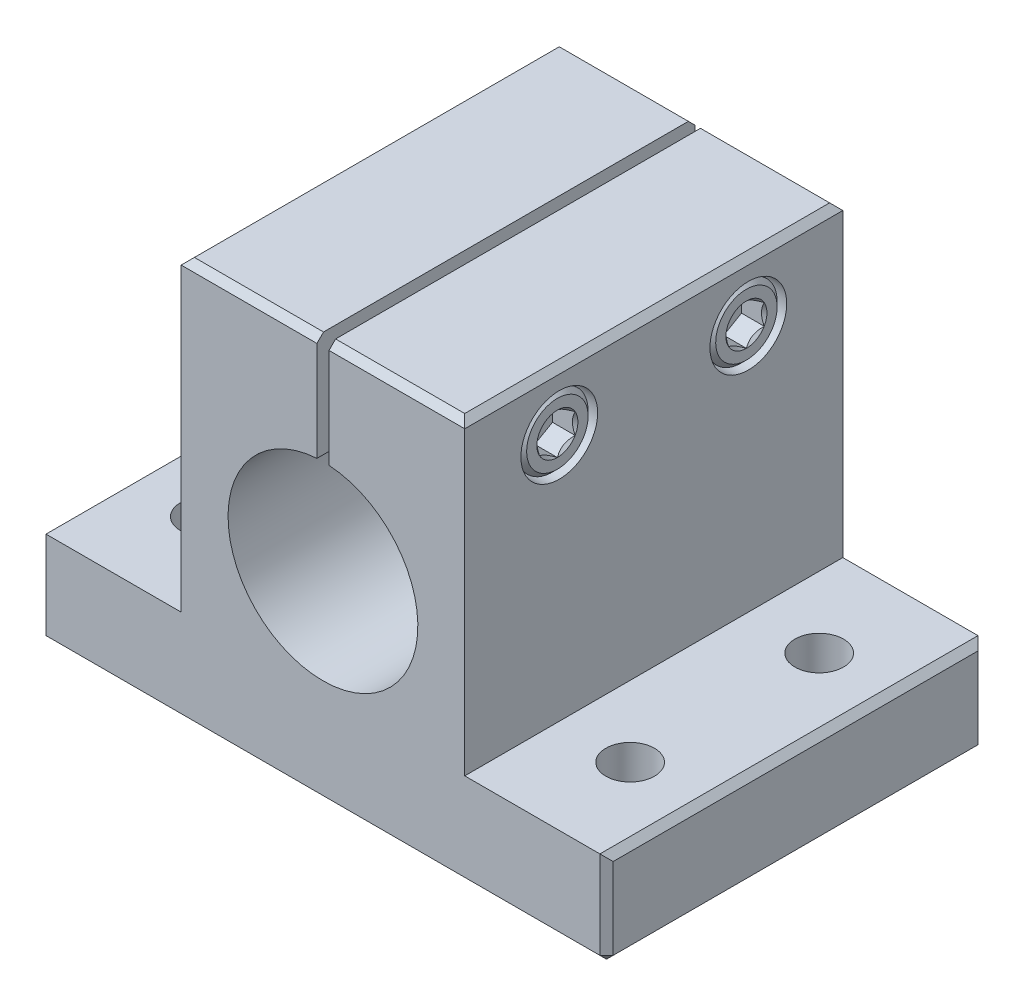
ISO-10303-21;
HEADER;
FILE_DESCRIPTION(('STEP AP214'),'2;1');
FILE_NAME('part.step','',(''),(''),'','','');
FILE_SCHEMA(('AUTOMOTIVE_DESIGN { 1 0 10303 214 1 1 1 1 }'));
ENDSEC;
DATA;
#1=APPLICATION_CONTEXT('core data for automotive mechanical design processes');
#2=APPLICATION_PROTOCOL_DEFINITION('international standard','automotive_design',2000,#1);
#3=PRODUCT_CONTEXT('',#1,'mechanical');
#4=PRODUCT('Part','Part','',(#3));
#5=PRODUCT_RELATED_PRODUCT_CATEGORY('part','',(#4));
#6=PRODUCT_DEFINITION_FORMATION('','',#4);
#7=PRODUCT_DEFINITION_CONTEXT('part definition',#1,'design');
#8=PRODUCT_DEFINITION('design','',#6,#7);
#9=PRODUCT_DEFINITION_SHAPE('','',#8);
#10=(LENGTH_UNIT() NAMED_UNIT(*) SI_UNIT(.MILLI.,.METRE.));
#11=(NAMED_UNIT(*) PLANE_ANGLE_UNIT() SI_UNIT($,.RADIAN.));
#12=(NAMED_UNIT(*) SI_UNIT($,.STERADIAN.) SOLID_ANGLE_UNIT());
#13=UNCERTAINTY_MEASURE_WITH_UNIT(LENGTH_MEASURE(1.E-05),#10,'distance_accuracy_value','');
#14=(GEOMETRIC_REPRESENTATION_CONTEXT(3) GLOBAL_UNCERTAINTY_ASSIGNED_CONTEXT((#13)) GLOBAL_UNIT_ASSIGNED_CONTEXT((#10,
#11,#12)) REPRESENTATION_CONTEXT('',''));
#15=CARTESIAN_POINT('',(0.,0.,0.));
#16=DIRECTION('',(0.,0.,1.));
#17=DIRECTION('',(1.,0.,0.));
#18=AXIS2_PLACEMENT_3D('',#15,#16,#17);
#19=CARTESIAN_POINT('',(-12.954,46.0248,-12.7));
#20=DIRECTION('',(-1.,0.,0.));
#21=DIRECTION('',(0.,-1.,0.));
#22=AXIS2_PLACEMENT_3D('',#19,#20,#21);
#23=PLANE('',#22);
#24=CARTESIAN_POINT('',(-12.954,46.0248,-12.7));
#25=DIRECTION('',(-1.,0.,0.));
#26=DIRECTION('',(0.,1.,0.));
#27=AXIS2_PLACEMENT_3D('',#24,#25,#26);
#28=CIRCLE('',#27,3.175);
#29=CARTESIAN_POINT('',(-12.954,49.1998,-12.7));
#30=VERTEX_POINT('',#29);
#31=EDGE_CURVE('E303',#30,#30,#28,.T.);
#32=ORIENTED_EDGE('',*,*,#31,.T.);
#33=EDGE_LOOP('',(#32));
#34=FACE_BOUND('',#33,.T.);
#35=ADVANCED_FACE('F290',(#34),#23,.T.);
#36=CARTESIAN_POINT('',(18.796,46.0248,-12.7));
#37=DIRECTION('',(1.,0.,0.));
#38=DIRECTION('',(0.,1.,0.));
#39=AXIS2_PLACEMENT_3D('',#36,#37,#38);
#40=CYLINDRICAL_SURFACE('',#39,3.175);
#41=ORIENTED_EDGE('',*,*,#31,.F.);
#42=EDGE_LOOP('',(#41));
#43=FACE_BOUND('',#42,.T.);
#44=CARTESIAN_POINT('',(12.446,46.0248,-12.7));
#45=DIRECTION('',(-1.,0.,0.));
#46=DIRECTION('',(0.,1.,0.));
#47=AXIS2_PLACEMENT_3D('',#44,#45,#46);
#48=CIRCLE('',#47,3.175);
#49=CARTESIAN_POINT('',(12.446,49.1998,-12.7));
#50=VERTEX_POINT('',#49);
#51=EDGE_CURVE('E459',#50,#50,#48,.T.);
#52=ORIENTED_EDGE('',*,*,#51,.T.);
#53=EDGE_LOOP('',(#52));
#54=FACE_BOUND('',#53,.T.);
#55=ADVANCED_FACE('F450',(#43,#54),#40,.T.);
#56=CARTESIAN_POINT('',(12.446,42.8498,-12.7));
#57=DIRECTION('',(-1.,0.,0.));
#58=DIRECTION('',(0.,-1.,0.));
#59=AXIS2_PLACEMENT_3D('',#56,#57,#58);
#60=PLANE('',#59);
#61=ORIENTED_EDGE('',*,*,#51,.F.);
#62=EDGE_LOOP('',(#61));
#63=FACE_BOUND('',#62,.T.);
#64=CARTESIAN_POINT('',(12.446,46.0248,-12.7));
#65=DIRECTION('',(-1.,0.,0.));
#66=DIRECTION('',(0.,1.,0.));
#67=AXIS2_PLACEMENT_3D('',#64,#65,#66);
#68=CIRCLE('',#67,4.63549999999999);
#69=CARTESIAN_POINT('',(12.446,50.6603,-12.7));
#70=VERTEX_POINT('',#69);
#71=EDGE_CURVE('E461',#70,#70,#68,.T.);
#72=ORIENTED_EDGE('',*,*,#71,.T.);
#73=EDGE_LOOP('',(#72));
#74=FACE_BOUND('',#73,.T.);
#75=ADVANCED_FACE('F455',(#63,#74),#60,.T.);
#76=CARTESIAN_POINT('',(12.573,46.0248,-12.7));
#77=DIRECTION('',(1.,0.,0.));
#78=DIRECTION('',(0.,1.,0.));
#79=AXIS2_PLACEMENT_3D('',#76,#77,#78);
#80=CONICAL_SURFACE('',#79,4.7625,0.785398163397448);
#81=ORIENTED_EDGE('',*,*,#71,.F.);
#82=EDGE_LOOP('',(#81));
#83=FACE_BOUND('',#82,.T.);
#84=CARTESIAN_POINT('',(12.573,46.0248,-12.7));
#85=DIRECTION('',(-1.,0.,0.));
#86=DIRECTION('',(0.,1.,0.));
#87=AXIS2_PLACEMENT_3D('',#84,#85,#86);
#88=CIRCLE('',#87,4.76249999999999);
#89=CARTESIAN_POINT('',(12.573,50.7873,-12.7));
#90=VERTEX_POINT('',#89);
#91=EDGE_CURVE('E466',#90,#90,#88,.T.);
#92=ORIENTED_EDGE('',*,*,#91,.T.);
#93=EDGE_LOOP('',(#92));
#94=FACE_BOUND('',#93,.T.);
#95=ADVANCED_FACE('F538',(#83,#94),#80,.T.);
#96=CARTESIAN_POINT('',(18.796,46.0248,-12.7));
#97=DIRECTION('',(1.,0.,0.));
#98=DIRECTION('',(0.,1.,0.));
#99=AXIS2_PLACEMENT_3D('',#96,#97,#98);
#100=CYLINDRICAL_SURFACE('',#99,4.7625);
#101=ORIENTED_EDGE('',*,*,#91,.F.);
#102=EDGE_LOOP('',(#101));
#103=FACE_BOUND('',#102,.T.);
#104=CARTESIAN_POINT('',(18.161,46.0248,-12.7));
#105=DIRECTION('',(-1.,0.,0.));
#106=DIRECTION('',(0.,1.,0.));
#107=AXIS2_PLACEMENT_3D('',#104,#105,#106);
#108=CIRCLE('',#107,4.7625);
#109=CARTESIAN_POINT('',(18.161,50.7873,-12.7));
#110=VERTEX_POINT('',#109);
#111=EDGE_CURVE('E469',#110,#110,#108,.T.);
#112=ORIENTED_EDGE('',*,*,#111,.T.);
#113=EDGE_LOOP('',(#112));
#114=FACE_BOUND('',#113,.T.);
#115=ADVANCED_FACE('F531',(#103,#114),#100,.T.);
#116=CARTESIAN_POINT('',(18.796,46.0248,-12.7));
#117=DIRECTION('',(-1.,0.,0.));
#118=DIRECTION('',(0.,-1.,0.));
#119=AXIS2_PLACEMENT_3D('',#116,#117,#118);
#120=CONICAL_SURFACE('',#119,4.1275,0.785398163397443);
#121=ORIENTED_EDGE('',*,*,#111,.F.);
#122=EDGE_LOOP('',(#121));
#123=FACE_BOUND('',#122,.T.);
#124=CARTESIAN_POINT('',(18.796,46.0248,-12.7));
#125=DIRECTION('',(-1.,0.,0.));
#126=DIRECTION('',(0.,1.,0.));
#127=AXIS2_PLACEMENT_3D('',#124,#125,#126);
#128=CIRCLE('',#127,4.1275);
#129=CARTESIAN_POINT('',(18.796,50.1523,-12.7));
#130=VERTEX_POINT('',#129);
#131=EDGE_CURVE('E472',#130,#130,#128,.T.);
#132=ORIENTED_EDGE('',*,*,#131,.T.);
#133=EDGE_LOOP('',(#132));
#134=FACE_BOUND('',#133,.T.);
#135=ADVANCED_FACE('F526',(#123,#134),#120,.T.);
#136=CARTESIAN_POINT('',(18.796,41.8973,-12.7));
#137=DIRECTION('',(1.,0.,0.));
#138=DIRECTION('',(0.,1.,0.));
#139=AXIS2_PLACEMENT_3D('',#136,#137,#138);
#140=PLANE('',#139);
#141=CARTESIAN_POINT('',(18.796,46.0248,-12.7));
#142=DIRECTION('',(-1.,0.,0.));
#143=DIRECTION('',(0.,1.,0.));
#144=AXIS2_PLACEMENT_3D('',#141,#142,#143);
#145=CIRCLE('',#144,2.75696300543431);
#146=CARTESIAN_POINT('',(18.796,48.7817630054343,-12.7));
#147=VERTEX_POINT('',#146);
#148=CARTESIAN_POINT('',(18.796,47.4032815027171,-15.0876));
#149=VERTEX_POINT('',#148);
#150=EDGE_CURVE('E381',#147,#149,#145,.T.);
#151=ORIENTED_EDGE('',*,*,#150,.T.);
#152=CARTESIAN_POINT('',(18.796,44.6463184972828,-15.0876));
#153=VERTEX_POINT('',#152);
#154=EDGE_CURVE('E388',#149,#153,#145,.T.);
#155=ORIENTED_EDGE('',*,*,#154,.T.);
#156=CARTESIAN_POINT('',(18.796,43.2678369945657,-12.7));
#157=VERTEX_POINT('',#156);
#158=EDGE_CURVE('E392',#153,#157,#145,.T.);
#159=ORIENTED_EDGE('',*,*,#158,.T.);
#160=CARTESIAN_POINT('',(18.796,44.6463184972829,-10.3124));
#161=VERTEX_POINT('',#160);
#162=EDGE_CURVE('E504',#157,#161,#145,.T.);
#163=ORIENTED_EDGE('',*,*,#162,.T.);
#164=CARTESIAN_POINT('',(18.796,47.4032815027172,-10.3124));
#165=VERTEX_POINT('',#164);
#166=EDGE_CURVE('E384',#161,#165,#145,.T.);
#167=ORIENTED_EDGE('',*,*,#166,.T.);
#168=EDGE_CURVE('E367',#165,#147,#145,.T.);
#169=ORIENTED_EDGE('',*,*,#168,.T.);
#170=EDGE_LOOP('',(#151,#155,#159,#163,#167,#169));
#171=FACE_BOUND('',#170,.T.);
#172=ORIENTED_EDGE('',*,*,#131,.F.);
#173=EDGE_LOOP('',(#172));
#174=FACE_BOUND('',#173,.T.);
#175=ADVANCED_FACE('F378',(#171,#174),#140,.T.);
#176=CARTESIAN_POINT('',(18.796,46.0248,-12.7));
#177=DIRECTION('',(1.,0.,0.));
#178=DIRECTION('',(0.,1.,0.));
#179=AXIS2_PLACEMENT_3D('',#176,#177,#178);
#180=CONICAL_SURFACE('',#179,2.75696300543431,0.78539816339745);
#181=ORIENTED_EDGE('',*,*,#150,.F.);
#182=CARTESIAN_POINT('',(18.7961154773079,48.7818784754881,-12.6998));
#183=CARTESIAN_POINT('',(18.7487690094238,48.7344924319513,-12.7818750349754));
#184=CARTESIAN_POINT('',(18.7042031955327,48.6863140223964,-12.8653224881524));
#185=CARTESIAN_POINT('',(18.6226041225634,48.5880728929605,-13.0354811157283));
#186=CARTESIAN_POINT('',(18.5856162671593,48.53800082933,-13.1222084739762));
#187=CARTESIAN_POINT('',(18.5222552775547,48.4370328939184,-13.2970900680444));
#188=CARTESIAN_POINT('',(18.4957228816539,48.3861627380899,-13.3851997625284));
#189=CARTESIAN_POINT('',(18.4548441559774,48.2833024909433,-13.5633589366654));
#190=CARTESIAN_POINT('',(18.4404673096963,48.2313155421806,-13.6534029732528));
#191=CARTESIAN_POINT('',(18.4274957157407,48.1417193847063,-13.8085880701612));
#192=CARTESIAN_POINT('',(18.4255754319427,48.1042259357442,-13.8735286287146));
#193=CARTESIAN_POINT('',(18.4288100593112,48.0293003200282,-14.0033036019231));
#194=CARTESIAN_POINT('',(18.4339674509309,47.9918681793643,-14.068137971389));
#195=CARTESIAN_POINT('',(18.4510639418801,47.9173573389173,-14.1971945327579));
#196=CARTESIAN_POINT('',(18.4630106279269,47.8802790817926,-14.2614159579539));
#197=CARTESIAN_POINT('',(18.4930299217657,47.8067637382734,-14.3887482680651));
#198=CARTESIAN_POINT('',(18.5111020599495,47.7703266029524,-14.4518592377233));
#199=CARTESIAN_POINT('',(18.5647537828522,47.6769944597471,-14.6135152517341));
#200=CARTESIAN_POINT('',(18.6043777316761,47.6206781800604,-14.7110579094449));
#201=CARTESIAN_POINT('',(18.6712684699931,47.5378700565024,-14.8544857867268));
#202=CARTESIAN_POINT('',(18.6947708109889,47.5105810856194,-14.9017516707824));
#203=CARTESIAN_POINT('',(18.7439179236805,47.4565086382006,-14.9954078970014));
#204=CARTESIAN_POINT('',(18.7695613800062,47.4297248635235,-15.0417987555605));
#205=CARTESIAN_POINT('',(18.7961154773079,47.4031660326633,-15.0878));
#206=B_SPLINE_CURVE_WITH_KNOTS('',3,(#182,#183,#184,#185,#186,#187,#188,#189,#190,#191,#192,
#193,#194,#195,#196,#197,#198,#199,#200,#201,#202,#203,#204,#205),.UNSPECIFIED.,.F.,.F.,(4,2,2,
2,2,2,2,2,2,2,2,4),(0.,0.318042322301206,0.637937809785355,0.952752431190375,1.2667743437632,
1.49149028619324,1.71628500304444,1.94133141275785,2.16636057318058,2.52380766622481,
2.70204658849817,2.88017680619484),.UNSPECIFIED.);
#207=EDGE_CURVE('E13',#147,#149,#206,.T.);
#208=ORIENTED_EDGE('',*,*,#207,.T.);
#209=EDGE_LOOP('',(#181,#208));
#210=FACE_BOUND('',#209,.T.);
#211=ADVANCED_FACE('F386',(#210),#180,.F.);
#212=ORIENTED_EDGE('',*,*,#154,.F.);
#213=CARTESIAN_POINT('',(19.6803328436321,43.2755452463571,-15.0876));
#214=CARTESIAN_POINT('',(19.6298022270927,43.3424865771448,-15.0876));
#215=CARTESIAN_POINT('',(19.5797600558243,43.4098027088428,-15.0876));
#216=CARTESIAN_POINT('',(19.4808712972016,43.5453324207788,-15.0876));
#217=CARTESIAN_POINT('',(19.4320250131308,43.613546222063,-15.0876));
#218=CARTESIAN_POINT('',(19.3353994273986,43.7515181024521,-15.0876));
#219=CARTESIAN_POINT('',(19.2876313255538,43.8212840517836,-15.0876));
#220=CARTESIAN_POINT('',(19.193878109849,43.9620001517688,-15.0876));
#221=CARTESIAN_POINT('',(19.1478928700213,44.0329502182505,-15.0876));
#222=CARTESIAN_POINT('',(19.0555361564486,44.1803169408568,-15.0876));
#223=CARTESIAN_POINT('',(19.0092927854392,44.2568142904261,-15.0876));
#224=CARTESIAN_POINT('',(18.9198476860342,44.41159598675,-15.0876));
#225=CARTESIAN_POINT('',(18.8766464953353,44.4898806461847,-15.0876));
#226=CARTESIAN_POINT('',(18.7942217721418,44.6482226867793,-15.0876));
#227=CARTESIAN_POINT('',(18.7549862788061,44.7282737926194,-15.0876));
#228=CARTESIAN_POINT('',(18.6813630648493,44.8905691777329,-15.0876));
#229=CARTESIAN_POINT('',(18.6469737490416,44.9728127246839,-15.0876));
#230=CARTESIAN_POINT('',(18.586798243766,45.1328926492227,-15.0876));
#231=CARTESIAN_POINT('',(18.5605422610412,45.2105505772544,-15.0876));
#232=CARTESIAN_POINT('',(18.5142604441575,45.3677361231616,-15.0876));
#233=CARTESIAN_POINT('',(18.4942350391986,45.4472638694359,-15.0876));
#234=CARTESIAN_POINT('',(18.4617932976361,45.6063914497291,-15.0876));
#235=CARTESIAN_POINT('',(18.4492465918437,45.6859642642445,-15.0876));
#236=CARTESIAN_POINT('',(18.4320057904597,45.8459605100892,-15.0876));
#237=CARTESIAN_POINT('',(18.4273103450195,45.9263837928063,-15.0876));
#238=CARTESIAN_POINT('',(18.4261207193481,46.0843772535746,-15.0876));
#239=CARTESIAN_POINT('',(18.4293358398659,46.1619453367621,-15.0876));
#240=CARTESIAN_POINT('',(18.4431486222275,46.3164165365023,-15.0876));
#241=CARTESIAN_POINT('',(18.45374700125,46.3933195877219,-15.0876));
#242=CARTESIAN_POINT('',(18.4819275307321,46.5472068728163,-15.0876));
#243=CARTESIAN_POINT('',(18.4996285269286,46.6241690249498,-15.0876));
#244=CARTESIAN_POINT('',(18.5410733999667,46.7764087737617,-15.0876));
#245=CARTESIAN_POINT('',(18.5648167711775,46.8516865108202,-15.0876));
#246=CARTESIAN_POINT('',(18.6485025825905,47.0887076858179,-15.0876));
#247=CARTESIAN_POINT('',(18.7179764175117,47.2470986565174,-15.0876));
#248=CARTESIAN_POINT('',(18.8337645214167,47.4788772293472,-15.0876));
#249=CARTESIAN_POINT('',(18.8743815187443,47.5553134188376,-15.0876));
#250=CARTESIAN_POINT('',(18.9587354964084,47.7064486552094,-15.0876));
#251=CARTESIAN_POINT('',(19.0024719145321,47.781148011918,-15.0876));
#252=CARTESIAN_POINT('',(19.090194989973,47.9253361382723,-15.0876));
#253=CARTESIAN_POINT('',(19.1340608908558,47.9948992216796,-15.0876));
#254=CARTESIAN_POINT('',(19.2236384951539,48.132832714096,-15.0876));
#255=CARTESIAN_POINT('',(19.2693503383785,48.201203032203,-15.0876));
#256=CARTESIAN_POINT('',(19.3619110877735,48.3363509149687,-15.0876));
#257=CARTESIAN_POINT('',(19.4087477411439,48.4031369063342,-15.0876));
#258=CARTESIAN_POINT('',(19.5036596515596,48.5357961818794,-15.0876));
#259=CARTESIAN_POINT('',(19.5517345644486,48.6016697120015,-15.0876));
#260=CARTESIAN_POINT('',(19.6003158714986,48.667161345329,-15.0876));
#261=B_SPLINE_CURVE_WITH_KNOTS('',3,(#213,#214,#215,#216,#217,#218,#219,#220,#221,#222,#223,
#224,#225,#226,#227,#228,#229,#230,#231,#232,#233,#234,#235,#236,#237,#238,#239,#240,#241,#242,
#243,#244,#245,#246,#247,#248,#249,#250,#251,#252,#253,#254,#255,#256,#257,#258,#259,#260),
.UNSPECIFIED.,.F.,.F.,(4,2,2,2,2,2,2,2,2,2,2,2,2,2,2,2,2,2,2,2,2,2,2,4),(0.,0.251620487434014,
0.503304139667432,0.756937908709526,1.01055372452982,1.27866277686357,1.54681909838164,
1.81414086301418,2.08137442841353,2.32708758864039,2.57281767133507,2.81412838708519,
3.05539761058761,3.28793391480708,3.52049280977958,3.75711710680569,3.99372160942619,
4.51097867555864,4.77063108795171,5.0302368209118,5.27692397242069,5.52362984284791,
5.76833169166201,6.01296624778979),.UNSPECIFIED.);
#262=EDGE_CURVE('E387',#149,#153,#261,.F.);
#263=ORIENTED_EDGE('',*,*,#262,.T.);
#264=EDGE_LOOP('',(#212,#263));
#265=FACE_BOUND('',#264,.T.);
#266=ADVANCED_FACE('F498',(#265),#180,.F.);
#267=ORIENTED_EDGE('',*,*,#158,.F.);
#268=CARTESIAN_POINT('',(18.7961154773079,44.6464339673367,-15.0878));
#269=CARTESIAN_POINT('',(18.7487690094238,44.5990479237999,-15.0057249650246));
#270=CARTESIAN_POINT('',(18.7042031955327,44.550869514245,-14.9222775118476));
#271=CARTESIAN_POINT('',(18.6226041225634,44.4526283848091,-14.7521188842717));
#272=CARTESIAN_POINT('',(18.5856162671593,44.4025563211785,-14.6653915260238));
#273=CARTESIAN_POINT('',(18.5222552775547,44.3015883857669,-14.4905099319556));
#274=CARTESIAN_POINT('',(18.4957228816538,44.2507182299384,-14.4024002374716));
#275=CARTESIAN_POINT('',(18.4548441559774,44.1478579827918,-14.2242410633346));
#276=CARTESIAN_POINT('',(18.4404673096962,44.0958710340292,-14.1341970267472));
#277=CARTESIAN_POINT('',(18.4274957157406,44.0062748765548,-13.9790119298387));
#278=CARTESIAN_POINT('',(18.4255754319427,43.9687814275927,-13.9140713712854));
#279=CARTESIAN_POINT('',(18.4288100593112,43.8938558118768,-13.7842963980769));
#280=CARTESIAN_POINT('',(18.4339674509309,43.8564236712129,-13.719462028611));
#281=CARTESIAN_POINT('',(18.45106394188,43.7819128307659,-13.5904054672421));
#282=CARTESIAN_POINT('',(18.4630106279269,43.7448345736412,-13.5261840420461));
#283=CARTESIAN_POINT('',(18.4930299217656,43.671319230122,-13.3988517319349));
#284=CARTESIAN_POINT('',(18.5111020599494,43.634882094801,-13.3357407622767));
#285=CARTESIAN_POINT('',(18.5647537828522,43.5415499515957,-13.1740847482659));
#286=CARTESIAN_POINT('',(18.6043777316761,43.4852336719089,-13.0765420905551));
#287=CARTESIAN_POINT('',(18.6712684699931,43.4024255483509,-12.9331142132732));
#288=CARTESIAN_POINT('',(18.6947708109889,43.3751365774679,-12.8858483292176));
#289=CARTESIAN_POINT('',(18.7439179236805,43.3210641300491,-12.7921921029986));
#290=CARTESIAN_POINT('',(18.7695613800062,43.2942803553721,-12.7458012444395));
#291=CARTESIAN_POINT('',(18.7961154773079,43.2677215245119,-12.6998));
#292=B_SPLINE_CURVE_WITH_KNOTS('',3,(#268,#269,#270,#271,#272,#273,#274,#275,#276,#277,#278,
#279,#280,#281,#282,#283,#284,#285,#286,#287,#288,#289,#290,#291),.UNSPECIFIED.,.F.,.F.,(4,2,2,
2,2,2,2,2,2,2,2,4),(0.,0.318042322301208,0.637937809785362,0.952752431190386,1.26677434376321,
1.49149028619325,1.71628500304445,1.94133141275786,2.16636057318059,2.52380766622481,
2.70204658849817,2.88017680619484),.UNSPECIFIED.);
#293=EDGE_CURVE('E390',#153,#157,#292,.T.);
#294=ORIENTED_EDGE('',*,*,#293,.T.);
#295=EDGE_LOOP('',(#267,#294));
#296=FACE_BOUND('',#295,.T.);
#297=ADVANCED_FACE('F502',(#296),#180,.F.);
#298=ORIENTED_EDGE('',*,*,#162,.F.);
#299=CARTESIAN_POINT('',(18.7961154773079,43.2677215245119,-12.7002));
#300=CARTESIAN_POINT('',(18.7487690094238,43.3151075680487,-12.6181249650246));
#301=CARTESIAN_POINT('',(18.7042031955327,43.3632859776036,-12.5346775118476));
#302=CARTESIAN_POINT('',(18.6226041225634,43.4615271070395,-12.3645188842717));
#303=CARTESIAN_POINT('',(18.5856162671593,43.51159917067,-12.2777915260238));
#304=CARTESIAN_POINT('',(18.5222552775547,43.6125671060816,-12.1029099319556));
#305=CARTESIAN_POINT('',(18.4957228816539,43.6634372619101,-12.0148002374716));
#306=CARTESIAN_POINT('',(18.4548441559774,43.7662975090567,-11.8366410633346));
#307=CARTESIAN_POINT('',(18.4404673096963,43.8182844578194,-11.7465970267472));
#308=CARTESIAN_POINT('',(18.4274957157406,43.9078806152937,-11.5914119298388));
#309=CARTESIAN_POINT('',(18.4255754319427,43.9453740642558,-11.5264713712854));
#310=CARTESIAN_POINT('',(18.4288100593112,44.0202996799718,-11.3966963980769));
#311=CARTESIAN_POINT('',(18.4339674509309,44.0577318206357,-11.331862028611));
#312=CARTESIAN_POINT('',(18.4510639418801,44.1322426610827,-11.2028054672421));
#313=CARTESIAN_POINT('',(18.4630106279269,44.1693209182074,-11.1385840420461));
#314=CARTESIAN_POINT('',(18.4930299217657,44.2428362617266,-11.0112517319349));
#315=CARTESIAN_POINT('',(18.5111020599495,44.2792733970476,-10.9481407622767));
#316=CARTESIAN_POINT('',(18.5647537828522,44.3726055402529,-10.7864847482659));
#317=CARTESIAN_POINT('',(18.6043777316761,44.4289218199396,-10.6889420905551));
#318=CARTESIAN_POINT('',(18.6712684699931,44.5117299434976,-10.5455142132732));
#319=CARTESIAN_POINT('',(18.6947708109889,44.5390189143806,-10.4982483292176));
#320=CARTESIAN_POINT('',(18.7439179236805,44.5930913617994,-10.4045921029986));
#321=CARTESIAN_POINT('',(18.7695613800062,44.6198751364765,-10.3582012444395));
#322=CARTESIAN_POINT('',(18.7961154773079,44.6464339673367,-10.3122));
#323=B_SPLINE_CURVE_WITH_KNOTS('',3,(#299,#300,#301,#302,#303,#304,#305,#306,#307,#308,#309,
#310,#311,#312,#313,#314,#315,#316,#317,#318,#319,#320,#321,#322),.UNSPECIFIED.,.F.,.F.,(4,2,2,
2,2,2,2,2,2,2,2,4),(0.,0.318042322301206,0.637937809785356,0.952752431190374,1.2667743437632,
1.49149028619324,1.71628500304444,1.94133141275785,2.16636057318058,2.5238076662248,
2.70204658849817,2.88017680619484),.UNSPECIFIED.);
#324=EDGE_CURVE('E418',#157,#161,#323,.T.);
#325=ORIENTED_EDGE('',*,*,#324,.T.);
#326=EDGE_LOOP('',(#298,#325));
#327=FACE_BOUND('',#326,.T.);
#328=ADVANCED_FACE('F507',(#327),#180,.F.);
#329=ORIENTED_EDGE('',*,*,#166,.F.);
#330=CARTESIAN_POINT('',(19.6803328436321,43.2755452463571,-10.3124));
#331=CARTESIAN_POINT('',(19.6298022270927,43.3424865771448,-10.3124));
#332=CARTESIAN_POINT('',(19.5797600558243,43.4098027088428,-10.3124));
#333=CARTESIAN_POINT('',(19.4808712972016,43.5453324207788,-10.3124));
#334=CARTESIAN_POINT('',(19.4320250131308,43.613546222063,-10.3124));
#335=CARTESIAN_POINT('',(19.3353994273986,43.7515181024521,-10.3124));
#336=CARTESIAN_POINT('',(19.2876313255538,43.8212840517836,-10.3124));
#337=CARTESIAN_POINT('',(19.193878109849,43.9620001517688,-10.3124));
#338=CARTESIAN_POINT('',(19.1478928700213,44.0329502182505,-10.3124));
#339=CARTESIAN_POINT('',(19.0555361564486,44.1803169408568,-10.3124));
#340=CARTESIAN_POINT('',(19.0092927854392,44.2568142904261,-10.3124));
#341=CARTESIAN_POINT('',(18.9198476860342,44.41159598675,-10.3124));
#342=CARTESIAN_POINT('',(18.8766464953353,44.4898806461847,-10.3124));
#343=CARTESIAN_POINT('',(18.7942217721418,44.6482226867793,-10.3124));
#344=CARTESIAN_POINT('',(18.7549862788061,44.7282737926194,-10.3124));
#345=CARTESIAN_POINT('',(18.6813630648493,44.8905691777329,-10.3124));
#346=CARTESIAN_POINT('',(18.6469737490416,44.9728127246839,-10.3124));
#347=CARTESIAN_POINT('',(18.586798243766,45.1328926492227,-10.3124));
#348=CARTESIAN_POINT('',(18.5605422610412,45.2105505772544,-10.3124));
#349=CARTESIAN_POINT('',(18.5142604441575,45.3677361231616,-10.3124));
#350=CARTESIAN_POINT('',(18.4942350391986,45.4472638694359,-10.3124));
#351=CARTESIAN_POINT('',(18.4617932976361,45.6063914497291,-10.3124));
#352=CARTESIAN_POINT('',(18.4492465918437,45.6859642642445,-10.3124));
#353=CARTESIAN_POINT('',(18.4320057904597,45.8459605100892,-10.3124));
#354=CARTESIAN_POINT('',(18.4273103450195,45.9263837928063,-10.3124));
#355=CARTESIAN_POINT('',(18.4261207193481,46.0843772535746,-10.3124));
#356=CARTESIAN_POINT('',(18.4293358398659,46.1619453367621,-10.3124));
#357=CARTESIAN_POINT('',(18.4431486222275,46.3164165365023,-10.3124));
#358=CARTESIAN_POINT('',(18.45374700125,46.3933195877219,-10.3124));
#359=CARTESIAN_POINT('',(18.4819275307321,46.5472068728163,-10.3124));
#360=CARTESIAN_POINT('',(18.4996285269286,46.6241690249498,-10.3124));
#361=CARTESIAN_POINT('',(18.5410733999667,46.7764087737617,-10.3124));
#362=CARTESIAN_POINT('',(18.5648167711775,46.8516865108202,-10.3124));
#363=CARTESIAN_POINT('',(18.6485025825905,47.0887076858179,-10.3124));
#364=CARTESIAN_POINT('',(18.7179764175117,47.2470986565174,-10.3124));
#365=CARTESIAN_POINT('',(18.8337645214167,47.4788772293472,-10.3124));
#366=CARTESIAN_POINT('',(18.8743815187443,47.5553134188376,-10.3124));
#367=CARTESIAN_POINT('',(18.9587354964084,47.7064486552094,-10.3124));
#368=CARTESIAN_POINT('',(19.0024719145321,47.781148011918,-10.3124));
#369=CARTESIAN_POINT('',(19.090194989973,47.9253361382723,-10.3124));
#370=CARTESIAN_POINT('',(19.1340608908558,47.9948992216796,-10.3124));
#371=CARTESIAN_POINT('',(19.2236384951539,48.132832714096,-10.3124));
#372=CARTESIAN_POINT('',(19.2693503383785,48.201203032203,-10.3124));
#373=CARTESIAN_POINT('',(19.3619110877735,48.3363509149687,-10.3124));
#374=CARTESIAN_POINT('',(19.4087477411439,48.4031369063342,-10.3124));
#375=CARTESIAN_POINT('',(19.5036596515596,48.5357961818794,-10.3124));
#376=CARTESIAN_POINT('',(19.5517345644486,48.6016697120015,-10.3124));
#377=CARTESIAN_POINT('',(19.6003158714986,48.667161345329,-10.3124));
#378=B_SPLINE_CURVE_WITH_KNOTS('',3,(#330,#331,#332,#333,#334,#335,#336,#337,#338,#339,#340,
#341,#342,#343,#344,#345,#346,#347,#348,#349,#350,#351,#352,#353,#354,#355,#356,#357,#358,#359,
#360,#361,#362,#363,#364,#365,#366,#367,#368,#369,#370,#371,#372,#373,#374,#375,#376,#377),
.UNSPECIFIED.,.F.,.F.,(4,2,2,2,2,2,2,2,2,2,2,2,2,2,2,2,2,2,2,2,2,2,2,4),(0.,0.251620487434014,
0.503304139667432,0.756937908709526,1.01055372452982,1.27866277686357,1.54681909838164,
1.81414086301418,2.08137442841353,2.32708758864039,2.57281767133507,2.81412838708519,
3.05539761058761,3.28793391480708,3.52049280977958,3.75711710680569,3.99372160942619,
4.51097867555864,4.77063108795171,5.0302368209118,5.27692397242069,5.52362984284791,
5.76833169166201,6.01296624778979),.UNSPECIFIED.);
#379=EDGE_CURVE('E369',#161,#165,#378,.T.);
#380=ORIENTED_EDGE('',*,*,#379,.T.);
#381=EDGE_LOOP('',(#329,#380));
#382=FACE_BOUND('',#381,.T.);
#383=ADVANCED_FACE('F411',(#382),#180,.F.);
#384=ORIENTED_EDGE('',*,*,#168,.F.);
#385=CARTESIAN_POINT('',(18.7961154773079,47.4031660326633,-10.3122));
#386=CARTESIAN_POINT('',(18.7487690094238,47.4505520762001,-10.3942750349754));
#387=CARTESIAN_POINT('',(18.7042031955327,47.498730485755,-10.4777224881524));
#388=CARTESIAN_POINT('',(18.6226041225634,47.5969716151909,-10.6478811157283));
#389=CARTESIAN_POINT('',(18.5856162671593,47.6470436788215,-10.7346084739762));
#390=CARTESIAN_POINT('',(18.5222552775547,47.7480116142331,-10.9094900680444));
#391=CARTESIAN_POINT('',(18.4957228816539,47.7988817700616,-10.9975997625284));
#392=CARTESIAN_POINT('',(18.4548441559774,47.9017420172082,-11.1757589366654));
#393=CARTESIAN_POINT('',(18.4404673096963,47.9537289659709,-11.2658029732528));
#394=CARTESIAN_POINT('',(18.4274957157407,48.0433251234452,-11.4209880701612));
#395=CARTESIAN_POINT('',(18.4255754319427,48.0808185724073,-11.4859286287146));
#396=CARTESIAN_POINT('',(18.4288100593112,48.1557441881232,-11.6157036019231));
#397=CARTESIAN_POINT('',(18.4339674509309,48.1931763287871,-11.680537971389));
#398=CARTESIAN_POINT('',(18.4510639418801,48.2676871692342,-11.8095945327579));
#399=CARTESIAN_POINT('',(18.4630106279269,48.3047654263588,-11.8738159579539));
#400=CARTESIAN_POINT('',(18.4930299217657,48.3782807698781,-12.0011482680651));
#401=CARTESIAN_POINT('',(18.5111020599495,48.4147179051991,-12.0642592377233));
#402=CARTESIAN_POINT('',(18.5647537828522,48.5080500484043,-12.2259152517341));
#403=CARTESIAN_POINT('',(18.6043777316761,48.5643663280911,-12.3234579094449));
#404=CARTESIAN_POINT('',(18.6712684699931,48.6471744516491,-12.4668857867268));
#405=CARTESIAN_POINT('',(18.6947708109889,48.6744634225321,-12.5141516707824));
#406=CARTESIAN_POINT('',(18.7439179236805,48.7285358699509,-12.6078078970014));
#407=CARTESIAN_POINT('',(18.7695613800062,48.755319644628,-12.6541987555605));
#408=CARTESIAN_POINT('',(18.7961154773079,48.7818784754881,-12.7002));
#409=B_SPLINE_CURVE_WITH_KNOTS('',3,(#385,#386,#387,#388,#389,#390,#391,#392,#393,#394,#395,
#396,#397,#398,#399,#400,#401,#402,#403,#404,#405,#406,#407,#408),.UNSPECIFIED.,.F.,.F.,(4,2,2,
2,2,2,2,2,2,2,2,4),(0.,0.318042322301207,0.637937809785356,0.952752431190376,1.2667743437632,
1.49149028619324,1.71628500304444,1.94133141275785,2.16636057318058,2.52380766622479,
2.70204658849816,2.88017680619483),.UNSPECIFIED.);
#410=EDGE_CURVE('E352',#165,#147,#409,.T.);
#411=ORIENTED_EDGE('',*,*,#410,.T.);
#412=EDGE_LOOP('',(#384,#411));
#413=FACE_BOUND('',#412,.T.);
#414=ADVANCED_FACE('F365',(#413),#180,.F.);
#415=CARTESIAN_POINT('',(15.748,48.7817630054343,-12.7));
#416=DIRECTION('',(1.,0.,0.));
#417=DIRECTION('',(0.,0.,1.));
#418=AXIS2_PLACEMENT_3D('',#415,#416,#417);
#419=PLANE('',#418);
#420=DIRECTION('',(0.,0.499999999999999,-0.866025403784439));
#421=VECTOR('',#420,1.);
#422=CARTESIAN_POINT('',(15.748,47.4032815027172,-10.3124));
#423=LINE('',#422,#421);
#424=CARTESIAN_POINT('',(15.748,47.4032815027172,-10.3124));
#425=VERTEX_POINT('',#424);
#426=CARTESIAN_POINT('',(15.748,48.7817630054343,-12.7));
#427=VERTEX_POINT('',#426);
#428=EDGE_CURVE('E355',#425,#427,#423,.T.);
#429=ORIENTED_EDGE('',*,*,#428,.F.);
#430=DIRECTION('',(0.,1.,0.));
#431=VECTOR('',#430,1.);
#432=CARTESIAN_POINT('',(15.748,44.6463184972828,-10.3124));
#433=LINE('',#432,#431);
#434=CARTESIAN_POINT('',(15.748,44.6463184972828,-10.3124));
#435=VERTEX_POINT('',#434);
#436=EDGE_CURVE('E361',#435,#425,#433,.T.);
#437=ORIENTED_EDGE('',*,*,#436,.F.);
#438=DIRECTION('',(0.,0.499999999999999,0.866025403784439));
#439=VECTOR('',#438,1.);
#440=CARTESIAN_POINT('',(15.748,43.2678369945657,-12.7));
#441=LINE('',#440,#439);
#442=CARTESIAN_POINT('',(15.748,43.2678369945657,-12.7));
#443=VERTEX_POINT('',#442);
#444=EDGE_CURVE('E484',#443,#435,#441,.T.);
#445=ORIENTED_EDGE('',*,*,#444,.F.);
#446=DIRECTION('',(0.,-0.5,0.866025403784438));
#447=VECTOR('',#446,1.);
#448=CARTESIAN_POINT('',(15.748,44.6463184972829,-15.0876));
#449=LINE('',#448,#447);
#450=CARTESIAN_POINT('',(15.748,44.6463184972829,-15.0876));
#451=VERTEX_POINT('',#450);
#452=EDGE_CURVE('E486',#451,#443,#449,.T.);
#453=ORIENTED_EDGE('',*,*,#452,.F.);
#454=DIRECTION('',(0.,-1.,0.));
#455=VECTOR('',#454,1.);
#456=CARTESIAN_POINT('',(15.748,47.4032815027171,-15.0876));
#457=LINE('',#456,#455);
#458=CARTESIAN_POINT('',(15.748,47.4032815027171,-15.0876));
#459=VERTEX_POINT('',#458);
#460=EDGE_CURVE('E488',#459,#451,#457,.T.);
#461=ORIENTED_EDGE('',*,*,#460,.F.);
#462=DIRECTION('',(0.,-0.500000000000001,-0.866025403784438));
#463=VECTOR('',#462,1.);
#464=CARTESIAN_POINT('',(15.748,48.7817630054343,-12.7));
#465=LINE('',#464,#463);
#466=EDGE_CURVE('E491',#427,#459,#465,.T.);
#467=ORIENTED_EDGE('',*,*,#466,.F.);
#468=EDGE_LOOP('',(#429,#437,#445,#453,#461,#467));
#469=FACE_BOUND('',#468,.T.);
#470=ADVANCED_FACE('F410',(#469),#419,.T.);
#471=CARTESIAN_POINT('',(15.748,48.7817630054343,-12.7));
#472=DIRECTION('',(0.,0.866025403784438,-0.500000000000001));
#473=DIRECTION('',(0.,-0.500000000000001,-0.866025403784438));
#474=AXIS2_PLACEMENT_3D('',#471,#472,#473);
#475=PLANE('',#474);
#476=DIRECTION('',(1.,0.,0.));
#477=VECTOR('',#476,1.);
#478=CARTESIAN_POINT('',(15.748,48.7817630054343,-12.7));
#479=LINE('',#478,#477);
#480=EDGE_CURVE('E349',#427,#147,#479,.T.);
#481=ORIENTED_EDGE('',*,*,#480,.F.);
#482=ORIENTED_EDGE('',*,*,#466,.T.);
#483=DIRECTION('',(1.,0.,0.));
#484=VECTOR('',#483,1.);
#485=CARTESIAN_POINT('',(15.748,47.4032815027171,-15.0876));
#486=LINE('',#485,#484);
#487=EDGE_CURVE('E360',#459,#149,#486,.T.);
#488=ORIENTED_EDGE('',*,*,#487,.T.);
#489=ORIENTED_EDGE('',*,*,#207,.F.);
#490=EDGE_LOOP('',(#481,#482,#488,#489));
#491=FACE_BOUND('',#490,.T.);
#492=ADVANCED_FACE('F371',(#491),#475,.F.);
#493=CARTESIAN_POINT('',(15.748,47.4032815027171,-15.0876));
#494=DIRECTION('',(0.,0.,-1.));
#495=DIRECTION('',(1.,0.,0.));
#496=AXIS2_PLACEMENT_3D('',#493,#494,#495);
#497=PLANE('',#496);
#498=ORIENTED_EDGE('',*,*,#487,.F.);
#499=ORIENTED_EDGE('',*,*,#460,.T.);
#500=DIRECTION('',(1.,0.,0.));
#501=VECTOR('',#500,1.);
#502=CARTESIAN_POINT('',(15.748,44.6463184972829,-15.0876));
#503=LINE('',#502,#501);
#504=EDGE_CURVE('E477',#451,#153,#503,.T.);
#505=ORIENTED_EDGE('',*,*,#504,.T.);
#506=ORIENTED_EDGE('',*,*,#262,.F.);
#507=EDGE_LOOP('',(#498,#499,#505,#506));
#508=FACE_BOUND('',#507,.T.);
#509=ADVANCED_FACE('F405',(#508),#497,.F.);
#510=CARTESIAN_POINT('',(15.748,44.6463184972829,-15.0876));
#511=DIRECTION('',(0.,-0.866025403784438,-0.5));
#512=DIRECTION('',(0.,-0.5,0.866025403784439));
#513=AXIS2_PLACEMENT_3D('',#510,#511,#512);
#514=PLANE('',#513);
#515=ORIENTED_EDGE('',*,*,#504,.F.);
#516=ORIENTED_EDGE('',*,*,#452,.T.);
#517=DIRECTION('',(1.,0.,0.));
#518=VECTOR('',#517,1.);
#519=CARTESIAN_POINT('',(15.748,43.2678369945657,-12.7));
#520=LINE('',#519,#518);
#521=EDGE_CURVE('E318',#443,#157,#520,.T.);
#522=ORIENTED_EDGE('',*,*,#521,.T.);
#523=ORIENTED_EDGE('',*,*,#293,.F.);
#524=EDGE_LOOP('',(#515,#516,#522,#523));
#525=FACE_BOUND('',#524,.T.);
#526=ADVANCED_FACE('F442',(#525),#514,.F.);
#527=CARTESIAN_POINT('',(15.748,43.2678369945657,-12.7));
#528=DIRECTION('',(0.,-0.866025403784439,0.499999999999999));
#529=DIRECTION('',(0.,0.5,0.866025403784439));
#530=AXIS2_PLACEMENT_3D('',#527,#528,#529);
#531=PLANE('',#530);
#532=ORIENTED_EDGE('',*,*,#521,.F.);
#533=ORIENTED_EDGE('',*,*,#444,.T.);
#534=DIRECTION('',(1.,0.,0.));
#535=VECTOR('',#534,1.);
#536=CARTESIAN_POINT('',(15.748,44.6463184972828,-10.3124));
#537=LINE('',#536,#535);
#538=EDGE_CURVE('E310',#435,#161,#537,.T.);
#539=ORIENTED_EDGE('',*,*,#538,.T.);
#540=ORIENTED_EDGE('',*,*,#324,.F.);
#541=EDGE_LOOP('',(#532,#533,#539,#540));
#542=FACE_BOUND('',#541,.T.);
#543=ADVANCED_FACE('F438',(#542),#531,.F.);
#544=CARTESIAN_POINT('',(15.748,44.6463184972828,-10.3124));
#545=DIRECTION('',(0.,0.,1.));
#546=DIRECTION('',(-1.,0.,0.));
#547=AXIS2_PLACEMENT_3D('',#544,#545,#546);
#548=PLANE('',#547);
#549=ORIENTED_EDGE('',*,*,#538,.F.);
#550=ORIENTED_EDGE('',*,*,#436,.T.);
#551=DIRECTION('',(1.,0.,0.));
#552=VECTOR('',#551,1.);
#553=CARTESIAN_POINT('',(15.748,47.4032815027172,-10.3124));
#554=LINE('',#553,#552);
#555=EDGE_CURVE('E474',#425,#165,#554,.T.);
#556=ORIENTED_EDGE('',*,*,#555,.T.);
#557=ORIENTED_EDGE('',*,*,#379,.F.);
#558=EDGE_LOOP('',(#549,#550,#556,#557));
#559=FACE_BOUND('',#558,.T.);
#560=ADVANCED_FACE('F435',(#559),#548,.F.);
#561=CARTESIAN_POINT('',(15.748,47.4032815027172,-10.3124));
#562=DIRECTION('',(0.,0.866025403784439,0.499999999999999));
#563=DIRECTION('',(0.,0.499999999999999,-0.866025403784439));
#564=AXIS2_PLACEMENT_3D('',#561,#562,#563);
#565=PLANE('',#564);
#566=ORIENTED_EDGE('',*,*,#555,.F.);
#567=ORIENTED_EDGE('',*,*,#428,.T.);
#568=ORIENTED_EDGE('',*,*,#480,.T.);
#569=ORIENTED_EDGE('',*,*,#410,.F.);
#570=EDGE_LOOP('',(#566,#567,#568,#569));
#571=FACE_BOUND('',#570,.T.);
#572=ADVANCED_FACE('F351',(#571),#565,.F.);
#573=CLOSED_SHELL('',(#35,#55,#75,#95,#115,#135,#175,#211,#266,#297,#328,#383,#414,#470,#492,
#509,#526,#543,#560,#572));
#574=MANIFOLD_SOLID_BREP('B2',#573);
#575=CARTESIAN_POINT('',(-12.954,46.0248,12.7));
#576=DIRECTION('',(-1.,0.,0.));
#577=DIRECTION('',(0.,-1.,0.));
#578=AXIS2_PLACEMENT_3D('',#575,#576,#577);
#579=PLANE('',#578);
#580=CARTESIAN_POINT('',(-12.954,46.0248,12.7));
#581=DIRECTION('',(1.,0.,0.));
#582=DIRECTION('',(0.,1.,0.));
#583=AXIS2_PLACEMENT_3D('',#580,#581,#582);
#584=CIRCLE('',#583,3.175);
#585=CARTESIAN_POINT('',(-12.954,49.1998,12.7));
#586=VERTEX_POINT('',#585);
#587=EDGE_CURVE('E687',#586,#586,#584,.T.);
#588=ORIENTED_EDGE('',*,*,#587,.F.);
#589=EDGE_LOOP('',(#588));
#590=FACE_BOUND('',#589,.T.);
#591=ADVANCED_FACE('F674',(#590),#579,.T.);
#592=CARTESIAN_POINT('',(18.796,46.0248,12.7));
#593=DIRECTION('',(1.,0.,0.));
#594=DIRECTION('',(0.,1.,0.));
#595=AXIS2_PLACEMENT_3D('',#592,#593,#594);
#596=CYLINDRICAL_SURFACE('',#595,3.175);
#597=ORIENTED_EDGE('',*,*,#587,.T.);
#598=EDGE_LOOP('',(#597));
#599=FACE_BOUND('',#598,.T.);
#600=CARTESIAN_POINT('',(12.446,46.0248,12.7));
#601=DIRECTION('',(1.,0.,0.));
#602=DIRECTION('',(0.,1.,0.));
#603=AXIS2_PLACEMENT_3D('',#600,#601,#602);
#604=CIRCLE('',#603,3.175);
#605=CARTESIAN_POINT('',(12.446,49.1998,12.7));
#606=VERTEX_POINT('',#605);
#607=EDGE_CURVE('E853',#606,#606,#604,.T.);
#608=ORIENTED_EDGE('',*,*,#607,.F.);
#609=EDGE_LOOP('',(#608));
#610=FACE_BOUND('',#609,.T.);
#611=ADVANCED_FACE('F858',(#599,#610),#596,.T.);
#612=CARTESIAN_POINT('',(12.446,42.8498,12.7));
#613=DIRECTION('',(-1.,0.,0.));
#614=DIRECTION('',(0.,-1.,0.));
#615=AXIS2_PLACEMENT_3D('',#612,#613,#614);
#616=PLANE('',#615);
#617=ORIENTED_EDGE('',*,*,#607,.T.);
#618=EDGE_LOOP('',(#617));
#619=FACE_BOUND('',#618,.T.);
#620=CARTESIAN_POINT('',(12.446,46.0248,12.7));
#621=DIRECTION('',(1.,0.,0.));
#622=DIRECTION('',(0.,1.,0.));
#623=AXIS2_PLACEMENT_3D('',#620,#621,#622);
#624=CIRCLE('',#623,4.63549999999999);
#625=CARTESIAN_POINT('',(12.446,50.6603,12.7));
#626=VERTEX_POINT('',#625);
#627=EDGE_CURVE('E850',#626,#626,#624,.T.);
#628=ORIENTED_EDGE('',*,*,#627,.F.);
#629=EDGE_LOOP('',(#628));
#630=FACE_BOUND('',#629,.T.);
#631=ADVANCED_FACE('F865',(#619,#630),#616,.T.);
#632=CARTESIAN_POINT('',(12.573,46.0248,12.7));
#633=DIRECTION('',(1.,0.,0.));
#634=DIRECTION('',(0.,1.,0.));
#635=AXIS2_PLACEMENT_3D('',#632,#633,#634);
#636=CONICAL_SURFACE('',#635,4.7625,0.785398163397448);
#637=ORIENTED_EDGE('',*,*,#627,.T.);
#638=EDGE_LOOP('',(#637));
#639=FACE_BOUND('',#638,.T.);
#640=CARTESIAN_POINT('',(12.573,46.0248,12.7));
#641=DIRECTION('',(1.,0.,0.));
#642=DIRECTION('',(0.,1.,0.));
#643=AXIS2_PLACEMENT_3D('',#640,#641,#642);
#644=CIRCLE('',#643,4.76249999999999);
#645=CARTESIAN_POINT('',(12.573,50.7873,12.7));
#646=VERTEX_POINT('',#645);
#647=EDGE_CURVE('E847',#646,#646,#644,.T.);
#648=ORIENTED_EDGE('',*,*,#647,.F.);
#649=EDGE_LOOP('',(#648));
#650=FACE_BOUND('',#649,.T.);
#651=ADVANCED_FACE('F869',(#639,#650),#636,.T.);
#652=CARTESIAN_POINT('',(18.796,46.0248,12.7));
#653=DIRECTION('',(1.,0.,0.));
#654=DIRECTION('',(0.,1.,0.));
#655=AXIS2_PLACEMENT_3D('',#652,#653,#654);
#656=CYLINDRICAL_SURFACE('',#655,4.7625);
#657=ORIENTED_EDGE('',*,*,#647,.T.);
#658=EDGE_LOOP('',(#657));
#659=FACE_BOUND('',#658,.T.);
#660=CARTESIAN_POINT('',(18.161,46.0248,12.7));
#661=DIRECTION('',(1.,0.,0.));
#662=DIRECTION('',(0.,1.,0.));
#663=AXIS2_PLACEMENT_3D('',#660,#661,#662);
#664=CIRCLE('',#663,4.7625);
#665=CARTESIAN_POINT('',(18.161,50.7873,12.7));
#666=VERTEX_POINT('',#665);
#667=EDGE_CURVE('E844',#666,#666,#664,.T.);
#668=ORIENTED_EDGE('',*,*,#667,.F.);
#669=EDGE_LOOP('',(#668));
#670=FACE_BOUND('',#669,.T.);
#671=ADVANCED_FACE('F875',(#659,#670),#656,.T.);
#672=CARTESIAN_POINT('',(18.796,46.0248,12.7));
#673=DIRECTION('',(-1.,0.,0.));
#674=DIRECTION('',(0.,-1.,0.));
#675=AXIS2_PLACEMENT_3D('',#672,#673,#674);
#676=CONICAL_SURFACE('',#675,4.1275,0.785398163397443);
#677=ORIENTED_EDGE('',*,*,#667,.T.);
#678=EDGE_LOOP('',(#677));
#679=FACE_BOUND('',#678,.T.);
#680=CARTESIAN_POINT('',(18.796,46.0248,12.7));
#681=DIRECTION('',(1.,0.,0.));
#682=DIRECTION('',(0.,1.,0.));
#683=AXIS2_PLACEMENT_3D('',#680,#681,#682);
#684=CIRCLE('',#683,4.1275);
#685=CARTESIAN_POINT('',(18.796,50.1523,12.7));
#686=VERTEX_POINT('',#685);
#687=EDGE_CURVE('E831',#686,#686,#684,.T.);
#688=ORIENTED_EDGE('',*,*,#687,.F.);
#689=EDGE_LOOP('',(#688));
#690=FACE_BOUND('',#689,.T.);
#691=ADVANCED_FACE('F878',(#679,#690),#676,.T.);
#692=CARTESIAN_POINT('',(18.796,41.8973,12.7));
#693=DIRECTION('',(1.,0.,0.));
#694=DIRECTION('',(0.,1.,0.));
#695=AXIS2_PLACEMENT_3D('',#692,#693,#694);
#696=PLANE('',#695);
#697=CARTESIAN_POINT('',(18.796,46.0248,12.7));
#698=DIRECTION('',(1.,0.,0.));
#699=DIRECTION('',(0.,1.,0.));
#700=AXIS2_PLACEMENT_3D('',#697,#698,#699);
#701=CIRCLE('',#700,2.75696300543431);
#702=CARTESIAN_POINT('',(18.796,48.7817630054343,12.7));
#703=VERTEX_POINT('',#702);
#704=CARTESIAN_POINT('',(18.796,47.4032815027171,15.0876));
#705=VERTEX_POINT('',#704);
#706=EDGE_CURVE('E744',#703,#705,#701,.T.);
#707=ORIENTED_EDGE('',*,*,#706,.F.);
#708=CARTESIAN_POINT('',(18.796,47.4032815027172,10.3124));
#709=VERTEX_POINT('',#708);
#710=EDGE_CURVE('E733',#709,#703,#701,.T.);
#711=ORIENTED_EDGE('',*,*,#710,.F.);
#712=CARTESIAN_POINT('',(18.796,44.6463184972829,10.3124));
#713=VERTEX_POINT('',#712);
#714=EDGE_CURVE('E742',#713,#709,#701,.T.);
#715=ORIENTED_EDGE('',*,*,#714,.F.);
#716=CARTESIAN_POINT('',(18.796,43.2678369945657,12.7));
#717=VERTEX_POINT('',#716);
#718=EDGE_CURVE('E693',#717,#713,#701,.T.);
#719=ORIENTED_EDGE('',*,*,#718,.F.);
#720=CARTESIAN_POINT('',(18.796,44.6463184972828,15.0876));
#721=VERTEX_POINT('',#720);
#722=EDGE_CURVE('E700',#721,#717,#701,.T.);
#723=ORIENTED_EDGE('',*,*,#722,.F.);
#724=EDGE_CURVE('E771',#705,#721,#701,.T.);
#725=ORIENTED_EDGE('',*,*,#724,.F.);
#726=EDGE_LOOP('',(#707,#711,#715,#719,#723,#725));
#727=FACE_BOUND('',#726,.T.);
#728=ORIENTED_EDGE('',*,*,#687,.T.);
#729=EDGE_LOOP('',(#728));
#730=FACE_BOUND('',#729,.T.);
#731=ADVANCED_FACE('F769',(#727,#730),#696,.T.);
#732=CARTESIAN_POINT('',(18.796,46.0248,12.7));
#733=DIRECTION('',(1.,0.,0.));
#734=DIRECTION('',(0.,1.,0.));
#735=AXIS2_PLACEMENT_3D('',#732,#733,#734);
#736=CONICAL_SURFACE('',#735,2.75696300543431,0.78539816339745);
#737=ORIENTED_EDGE('',*,*,#706,.T.);
#738=CARTESIAN_POINT('',(18.7961154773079,48.7818784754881,12.6998));
#739=CARTESIAN_POINT('',(18.7487690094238,48.7344924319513,12.7818750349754));
#740=CARTESIAN_POINT('',(18.7042031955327,48.6863140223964,12.8653224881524));
#741=CARTESIAN_POINT('',(18.6226041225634,48.5880728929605,13.0354811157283));
#742=CARTESIAN_POINT('',(18.5856162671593,48.53800082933,13.1222084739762));
#743=CARTESIAN_POINT('',(18.5222552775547,48.4370328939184,13.2970900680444));
#744=CARTESIAN_POINT('',(18.4957228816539,48.3861627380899,13.3851997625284));
#745=CARTESIAN_POINT('',(18.4548441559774,48.2833024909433,13.5633589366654));
#746=CARTESIAN_POINT('',(18.4404673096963,48.2313155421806,13.6534029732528));
#747=CARTESIAN_POINT('',(18.4274957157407,48.1417193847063,13.8085880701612));
#748=CARTESIAN_POINT('',(18.4255754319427,48.1042259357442,13.8735286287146));
#749=CARTESIAN_POINT('',(18.4288100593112,48.0293003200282,14.0033036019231));
#750=CARTESIAN_POINT('',(18.4339674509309,47.9918681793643,14.068137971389));
#751=CARTESIAN_POINT('',(18.4510639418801,47.9173573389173,14.1971945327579));
#752=CARTESIAN_POINT('',(18.4630106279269,47.8802790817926,14.2614159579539));
#753=CARTESIAN_POINT('',(18.4930299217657,47.8067637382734,14.3887482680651));
#754=CARTESIAN_POINT('',(18.5111020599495,47.7703266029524,14.4518592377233));
#755=CARTESIAN_POINT('',(18.5647537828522,47.6769944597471,14.6135152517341));
#756=CARTESIAN_POINT('',(18.6043777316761,47.6206781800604,14.7110579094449));
#757=CARTESIAN_POINT('',(18.6712684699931,47.5378700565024,14.8544857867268));
#758=CARTESIAN_POINT('',(18.6947708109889,47.5105810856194,14.9017516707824));
#759=CARTESIAN_POINT('',(18.7439179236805,47.4565086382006,14.9954078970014));
#760=CARTESIAN_POINT('',(18.7695613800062,47.4297248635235,15.0417987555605));
#761=CARTESIAN_POINT('',(18.7961154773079,47.4031660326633,15.0878));
#762=B_SPLINE_CURVE_WITH_KNOTS('',3,(#738,#739,#740,#741,#742,#743,#744,#745,#746,#747,#748,
#749,#750,#751,#752,#753,#754,#755,#756,#757,#758,#759,#760,#761),.UNSPECIFIED.,.F.,.F.,(4,2,2,
2,2,2,2,2,2,2,2,4),(0.,0.318042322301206,0.637937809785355,0.952752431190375,1.2667743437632,
1.49149028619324,1.71628500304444,1.94133141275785,2.16636057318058,2.52380766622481,
2.70204658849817,2.88017680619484),.UNSPECIFIED.);
#763=EDGE_CURVE('E288',#703,#705,#762,.T.);
#764=ORIENTED_EDGE('',*,*,#763,.F.);
#765=EDGE_LOOP('',(#737,#764));
#766=FACE_BOUND('',#765,.T.);
#767=ADVANCED_FACE('F747',(#766),#736,.F.);
#768=ORIENTED_EDGE('',*,*,#724,.T.);
#769=CARTESIAN_POINT('',(19.6803328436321,43.2755452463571,15.0876));
#770=CARTESIAN_POINT('',(19.6298022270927,43.3424865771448,15.0876));
#771=CARTESIAN_POINT('',(19.5797600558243,43.4098027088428,15.0876));
#772=CARTESIAN_POINT('',(19.4808712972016,43.5453324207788,15.0876));
#773=CARTESIAN_POINT('',(19.4320250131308,43.613546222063,15.0876));
#774=CARTESIAN_POINT('',(19.3353994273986,43.7515181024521,15.0876));
#775=CARTESIAN_POINT('',(19.2876313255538,43.8212840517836,15.0876));
#776=CARTESIAN_POINT('',(19.193878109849,43.9620001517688,15.0876));
#777=CARTESIAN_POINT('',(19.1478928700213,44.0329502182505,15.0876));
#778=CARTESIAN_POINT('',(19.0555361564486,44.1803169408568,15.0876));
#779=CARTESIAN_POINT('',(19.0092927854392,44.2568142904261,15.0876));
#780=CARTESIAN_POINT('',(18.9198476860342,44.41159598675,15.0876));
#781=CARTESIAN_POINT('',(18.8766464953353,44.4898806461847,15.0876));
#782=CARTESIAN_POINT('',(18.7942217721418,44.6482226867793,15.0876));
#783=CARTESIAN_POINT('',(18.7549862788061,44.7282737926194,15.0876));
#784=CARTESIAN_POINT('',(18.6813630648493,44.8905691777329,15.0876));
#785=CARTESIAN_POINT('',(18.6469737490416,44.9728127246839,15.0876));
#786=CARTESIAN_POINT('',(18.586798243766,45.1328926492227,15.0876));
#787=CARTESIAN_POINT('',(18.5605422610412,45.2105505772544,15.0876));
#788=CARTESIAN_POINT('',(18.5142604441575,45.3677361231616,15.0876));
#789=CARTESIAN_POINT('',(18.4942350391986,45.4472638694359,15.0876));
#790=CARTESIAN_POINT('',(18.4617932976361,45.6063914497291,15.0876));
#791=CARTESIAN_POINT('',(18.4492465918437,45.6859642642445,15.0876));
#792=CARTESIAN_POINT('',(18.4320057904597,45.8459605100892,15.0876));
#793=CARTESIAN_POINT('',(18.4273103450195,45.9263837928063,15.0876));
#794=CARTESIAN_POINT('',(18.4261207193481,46.0843772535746,15.0876));
#795=CARTESIAN_POINT('',(18.4293358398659,46.1619453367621,15.0876));
#796=CARTESIAN_POINT('',(18.4431486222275,46.3164165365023,15.0876));
#797=CARTESIAN_POINT('',(18.45374700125,46.3933195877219,15.0876));
#798=CARTESIAN_POINT('',(18.4819275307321,46.5472068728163,15.0876));
#799=CARTESIAN_POINT('',(18.4996285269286,46.6241690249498,15.0876));
#800=CARTESIAN_POINT('',(18.5410733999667,46.7764087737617,15.0876));
#801=CARTESIAN_POINT('',(18.5648167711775,46.8516865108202,15.0876));
#802=CARTESIAN_POINT('',(18.6485025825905,47.0887076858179,15.0876));
#803=CARTESIAN_POINT('',(18.7179764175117,47.2470986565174,15.0876));
#804=CARTESIAN_POINT('',(18.8337645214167,47.4788772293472,15.0876));
#805=CARTESIAN_POINT('',(18.8743815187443,47.5553134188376,15.0876));
#806=CARTESIAN_POINT('',(18.9587354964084,47.7064486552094,15.0876));
#807=CARTESIAN_POINT('',(19.0024719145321,47.781148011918,15.0876));
#808=CARTESIAN_POINT('',(19.090194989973,47.9253361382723,15.0876));
#809=CARTESIAN_POINT('',(19.1340608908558,47.9948992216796,15.0876));
#810=CARTESIAN_POINT('',(19.2236384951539,48.132832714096,15.0876));
#811=CARTESIAN_POINT('',(19.2693503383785,48.201203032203,15.0876));
#812=CARTESIAN_POINT('',(19.3619110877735,48.3363509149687,15.0876));
#813=CARTESIAN_POINT('',(19.4087477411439,48.4031369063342,15.0876));
#814=CARTESIAN_POINT('',(19.5036596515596,48.5357961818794,15.0876));
#815=CARTESIAN_POINT('',(19.5517345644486,48.6016697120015,15.0876));
#816=CARTESIAN_POINT('',(19.6003158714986,48.667161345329,15.0876));
#817=B_SPLINE_CURVE_WITH_KNOTS('',3,(#769,#770,#771,#772,#773,#774,#775,#776,#777,#778,#779,
#780,#781,#782,#783,#784,#785,#786,#787,#788,#789,#790,#791,#792,#793,#794,#795,#796,#797,#798,
#799,#800,#801,#802,#803,#804,#805,#806,#807,#808,#809,#810,#811,#812,#813,#814,#815,#816),
.UNSPECIFIED.,.F.,.F.,(4,2,2,2,2,2,2,2,2,2,2,2,2,2,2,2,2,2,2,2,2,2,2,4),(0.,0.251620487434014,
0.503304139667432,0.756937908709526,1.01055372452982,1.27866277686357,1.54681909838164,
1.81414086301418,2.08137442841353,2.32708758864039,2.57281767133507,2.81412838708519,
3.05539761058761,3.28793391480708,3.52049280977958,3.75711710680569,3.99372160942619,
4.51097867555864,4.77063108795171,5.0302368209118,5.27692397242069,5.52362984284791,
5.76833169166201,6.01296624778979),.UNSPECIFIED.);
#818=EDGE_CURVE('E772',#705,#721,#817,.F.);
#819=ORIENTED_EDGE('',*,*,#818,.F.);
#820=EDGE_LOOP('',(#768,#819));
#821=FACE_BOUND('',#820,.T.);
#822=ADVANCED_FACE('F892',(#821),#736,.F.);
#823=ORIENTED_EDGE('',*,*,#722,.T.);
#824=CARTESIAN_POINT('',(18.7961154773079,44.6464339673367,15.0878));
#825=CARTESIAN_POINT('',(18.7487690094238,44.5990479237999,15.0057249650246));
#826=CARTESIAN_POINT('',(18.7042031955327,44.550869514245,14.9222775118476));
#827=CARTESIAN_POINT('',(18.6226041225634,44.4526283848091,14.7521188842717));
#828=CARTESIAN_POINT('',(18.5856162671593,44.4025563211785,14.6653915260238));
#829=CARTESIAN_POINT('',(18.5222552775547,44.3015883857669,14.4905099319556));
#830=CARTESIAN_POINT('',(18.4957228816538,44.2507182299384,14.4024002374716));
#831=CARTESIAN_POINT('',(18.4548441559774,44.1478579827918,14.2242410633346));
#832=CARTESIAN_POINT('',(18.4404673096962,44.0958710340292,14.1341970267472));
#833=CARTESIAN_POINT('',(18.4274957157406,44.0062748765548,13.9790119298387));
#834=CARTESIAN_POINT('',(18.4255754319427,43.9687814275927,13.9140713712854));
#835=CARTESIAN_POINT('',(18.4288100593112,43.8938558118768,13.7842963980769));
#836=CARTESIAN_POINT('',(18.4339674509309,43.8564236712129,13.719462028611));
#837=CARTESIAN_POINT('',(18.45106394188,43.7819128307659,13.5904054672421));
#838=CARTESIAN_POINT('',(18.4630106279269,43.7448345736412,13.5261840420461));
#839=CARTESIAN_POINT('',(18.4930299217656,43.671319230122,13.3988517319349));
#840=CARTESIAN_POINT('',(18.5111020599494,43.634882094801,13.3357407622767));
#841=CARTESIAN_POINT('',(18.5647537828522,43.5415499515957,13.1740847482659));
#842=CARTESIAN_POINT('',(18.6043777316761,43.4852336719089,13.0765420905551));
#843=CARTESIAN_POINT('',(18.6712684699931,43.4024255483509,12.9331142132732));
#844=CARTESIAN_POINT('',(18.6947708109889,43.3751365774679,12.8858483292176));
#845=CARTESIAN_POINT('',(18.7439179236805,43.3210641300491,12.7921921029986));
#846=CARTESIAN_POINT('',(18.7695613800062,43.2942803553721,12.7458012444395));
#847=CARTESIAN_POINT('',(18.7961154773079,43.2677215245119,12.6998));
#848=B_SPLINE_CURVE_WITH_KNOTS('',3,(#824,#825,#826,#827,#828,#829,#830,#831,#832,#833,#834,
#835,#836,#837,#838,#839,#840,#841,#842,#843,#844,#845,#846,#847),.UNSPECIFIED.,.F.,.F.,(4,2,2,
2,2,2,2,2,2,2,2,4),(0.,0.318042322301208,0.637937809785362,0.952752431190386,1.26677434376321,
1.49149028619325,1.71628500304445,1.94133141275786,2.16636057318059,2.52380766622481,
2.70204658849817,2.88017680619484),.UNSPECIFIED.);
#849=EDGE_CURVE('E774',#721,#717,#848,.T.);
#850=ORIENTED_EDGE('',*,*,#849,.F.);
#851=EDGE_LOOP('',(#823,#850));
#852=FACE_BOUND('',#851,.T.);
#853=ADVANCED_FACE('F896',(#852),#736,.F.);
#854=ORIENTED_EDGE('',*,*,#718,.T.);
#855=CARTESIAN_POINT('',(18.7961154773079,43.2677215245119,12.7002));
#856=CARTESIAN_POINT('',(18.7487690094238,43.3151075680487,12.6181249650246));
#857=CARTESIAN_POINT('',(18.7042031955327,43.3632859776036,12.5346775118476));
#858=CARTESIAN_POINT('',(18.6226041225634,43.4615271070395,12.3645188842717));
#859=CARTESIAN_POINT('',(18.5856162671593,43.51159917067,12.2777915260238));
#860=CARTESIAN_POINT('',(18.5222552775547,43.6125671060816,12.1029099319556));
#861=CARTESIAN_POINT('',(18.4957228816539,43.6634372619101,12.0148002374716));
#862=CARTESIAN_POINT('',(18.4548441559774,43.7662975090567,11.8366410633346));
#863=CARTESIAN_POINT('',(18.4404673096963,43.8182844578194,11.7465970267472));
#864=CARTESIAN_POINT('',(18.4274957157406,43.9078806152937,11.5914119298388));
#865=CARTESIAN_POINT('',(18.4255754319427,43.9453740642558,11.5264713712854));
#866=CARTESIAN_POINT('',(18.4288100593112,44.0202996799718,11.3966963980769));
#867=CARTESIAN_POINT('',(18.4339674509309,44.0577318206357,11.331862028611));
#868=CARTESIAN_POINT('',(18.4510639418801,44.1322426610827,11.2028054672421));
#869=CARTESIAN_POINT('',(18.4630106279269,44.1693209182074,11.1385840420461));
#870=CARTESIAN_POINT('',(18.4930299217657,44.2428362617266,11.0112517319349));
#871=CARTESIAN_POINT('',(18.5111020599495,44.2792733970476,10.9481407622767));
#872=CARTESIAN_POINT('',(18.5647537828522,44.3726055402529,10.7864847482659));
#873=CARTESIAN_POINT('',(18.6043777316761,44.4289218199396,10.6889420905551));
#874=CARTESIAN_POINT('',(18.6712684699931,44.5117299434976,10.5455142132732));
#875=CARTESIAN_POINT('',(18.6947708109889,44.5390189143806,10.4982483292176));
#876=CARTESIAN_POINT('',(18.7439179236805,44.5930913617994,10.4045921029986));
#877=CARTESIAN_POINT('',(18.7695613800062,44.6198751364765,10.3582012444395));
#878=CARTESIAN_POINT('',(18.7961154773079,44.6464339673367,10.3122));
#879=B_SPLINE_CURVE_WITH_KNOTS('',3,(#855,#856,#857,#858,#859,#860,#861,#862,#863,#864,#865,
#866,#867,#868,#869,#870,#871,#872,#873,#874,#875,#876,#877,#878),.UNSPECIFIED.,.F.,.F.,(4,2,2,
2,2,2,2,2,2,2,2,4),(0.,0.318042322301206,0.637937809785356,0.952752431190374,1.2667743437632,
1.49149028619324,1.71628500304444,1.94133141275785,2.16636057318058,2.5238076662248,
2.70204658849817,2.88017680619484),.UNSPECIFIED.);
#880=EDGE_CURVE('E912',#717,#713,#879,.T.);
#881=ORIENTED_EDGE('',*,*,#880,.F.);
#882=EDGE_LOOP('',(#854,#881));
#883=FACE_BOUND('',#882,.T.);
#884=ADVANCED_FACE('F905',(#883),#736,.F.);
#885=ORIENTED_EDGE('',*,*,#714,.T.);
#886=CARTESIAN_POINT('',(19.6803328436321,43.2755452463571,10.3124));
#887=CARTESIAN_POINT('',(19.6298022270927,43.3424865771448,10.3124));
#888=CARTESIAN_POINT('',(19.5797600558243,43.4098027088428,10.3124));
#889=CARTESIAN_POINT('',(19.4808712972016,43.5453324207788,10.3124));
#890=CARTESIAN_POINT('',(19.4320250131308,43.613546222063,10.3124));
#891=CARTESIAN_POINT('',(19.3353994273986,43.7515181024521,10.3124));
#892=CARTESIAN_POINT('',(19.2876313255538,43.8212840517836,10.3124));
#893=CARTESIAN_POINT('',(19.193878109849,43.9620001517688,10.3124));
#894=CARTESIAN_POINT('',(19.1478928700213,44.0329502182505,10.3124));
#895=CARTESIAN_POINT('',(19.0555361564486,44.1803169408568,10.3124));
#896=CARTESIAN_POINT('',(19.0092927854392,44.2568142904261,10.3124));
#897=CARTESIAN_POINT('',(18.9198476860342,44.41159598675,10.3124));
#898=CARTESIAN_POINT('',(18.8766464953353,44.4898806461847,10.3124));
#899=CARTESIAN_POINT('',(18.7942217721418,44.6482226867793,10.3124));
#900=CARTESIAN_POINT('',(18.7549862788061,44.7282737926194,10.3124));
#901=CARTESIAN_POINT('',(18.6813630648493,44.8905691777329,10.3124));
#902=CARTESIAN_POINT('',(18.6469737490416,44.9728127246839,10.3124));
#903=CARTESIAN_POINT('',(18.586798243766,45.1328926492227,10.3124));
#904=CARTESIAN_POINT('',(18.5605422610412,45.2105505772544,10.3124));
#905=CARTESIAN_POINT('',(18.5142604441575,45.3677361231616,10.3124));
#906=CARTESIAN_POINT('',(18.4942350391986,45.4472638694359,10.3124));
#907=CARTESIAN_POINT('',(18.4617932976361,45.6063914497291,10.3124));
#908=CARTESIAN_POINT('',(18.4492465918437,45.6859642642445,10.3124));
#909=CARTESIAN_POINT('',(18.4320057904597,45.8459605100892,10.3124));
#910=CARTESIAN_POINT('',(18.4273103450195,45.9263837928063,10.3124));
#911=CARTESIAN_POINT('',(18.4261207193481,46.0843772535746,10.3124));
#912=CARTESIAN_POINT('',(18.4293358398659,46.1619453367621,10.3124));
#913=CARTESIAN_POINT('',(18.4431486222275,46.3164165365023,10.3124));
#914=CARTESIAN_POINT('',(18.45374700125,46.3933195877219,10.3124));
#915=CARTESIAN_POINT('',(18.4819275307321,46.5472068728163,10.3124));
#916=CARTESIAN_POINT('',(18.4996285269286,46.6241690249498,10.3124));
#917=CARTESIAN_POINT('',(18.5410733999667,46.7764087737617,10.3124));
#918=CARTESIAN_POINT('',(18.5648167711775,46.8516865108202,10.3124));
#919=CARTESIAN_POINT('',(18.6485025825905,47.0887076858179,10.3124));
#920=CARTESIAN_POINT('',(18.7179764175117,47.2470986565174,10.3124));
#921=CARTESIAN_POINT('',(18.8337645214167,47.4788772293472,10.3124));
#922=CARTESIAN_POINT('',(18.8743815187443,47.5553134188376,10.3124));
#923=CARTESIAN_POINT('',(18.9587354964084,47.7064486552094,10.3124));
#924=CARTESIAN_POINT('',(19.0024719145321,47.781148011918,10.3124));
#925=CARTESIAN_POINT('',(19.090194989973,47.9253361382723,10.3124));
#926=CARTESIAN_POINT('',(19.1340608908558,47.9948992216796,10.3124));
#927=CARTESIAN_POINT('',(19.2236384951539,48.132832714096,10.3124));
#928=CARTESIAN_POINT('',(19.2693503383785,48.201203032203,10.3124));
#929=CARTESIAN_POINT('',(19.3619110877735,48.3363509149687,10.3124));
#930=CARTESIAN_POINT('',(19.4087477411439,48.4031369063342,10.3124));
#931=CARTESIAN_POINT('',(19.5036596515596,48.5357961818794,10.3124));
#932=CARTESIAN_POINT('',(19.5517345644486,48.6016697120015,10.3124));
#933=CARTESIAN_POINT('',(19.6003158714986,48.667161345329,10.3124));
#934=B_SPLINE_CURVE_WITH_KNOTS('',3,(#886,#887,#888,#889,#890,#891,#892,#893,#894,#895,#896,
#897,#898,#899,#900,#901,#902,#903,#904,#905,#906,#907,#908,#909,#910,#911,#912,#913,#914,#915,
#916,#917,#918,#919,#920,#921,#922,#923,#924,#925,#926,#927,#928,#929,#930,#931,#932,#933),
.UNSPECIFIED.,.F.,.F.,(4,2,2,2,2,2,2,2,2,2,2,2,2,2,2,2,2,2,2,2,2,2,2,4),(0.,0.251620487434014,
0.503304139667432,0.756937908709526,1.01055372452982,1.27866277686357,1.54681909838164,
1.81414086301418,2.08137442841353,2.32708758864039,2.57281767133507,2.81412838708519,
3.05539761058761,3.28793391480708,3.52049280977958,3.75711710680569,3.99372160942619,
4.51097867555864,4.77063108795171,5.0302368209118,5.27692397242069,5.52362984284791,
5.76833169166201,6.01296624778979),.UNSPECIFIED.);
#935=EDGE_CURVE('E759',#713,#709,#934,.T.);
#936=ORIENTED_EDGE('',*,*,#935,.F.);
#937=EDGE_LOOP('',(#885,#936));
#938=FACE_BOUND('',#937,.T.);
#939=ADVANCED_FACE('F899',(#938),#736,.F.);
#940=ORIENTED_EDGE('',*,*,#710,.T.);
#941=CARTESIAN_POINT('',(18.7961154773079,47.4031660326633,10.3122));
#942=CARTESIAN_POINT('',(18.7487690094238,47.4505520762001,10.3942750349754));
#943=CARTESIAN_POINT('',(18.7042031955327,47.498730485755,10.4777224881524));
#944=CARTESIAN_POINT('',(18.6226041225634,47.5969716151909,10.6478811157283));
#945=CARTESIAN_POINT('',(18.5856162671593,47.6470436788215,10.7346084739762));
#946=CARTESIAN_POINT('',(18.5222552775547,47.7480116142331,10.9094900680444));
#947=CARTESIAN_POINT('',(18.4957228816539,47.7988817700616,10.9975997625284));
#948=CARTESIAN_POINT('',(18.4548441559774,47.9017420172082,11.1757589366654));
#949=CARTESIAN_POINT('',(18.4404673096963,47.9537289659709,11.2658029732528));
#950=CARTESIAN_POINT('',(18.4274957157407,48.0433251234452,11.4209880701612));
#951=CARTESIAN_POINT('',(18.4255754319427,48.0808185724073,11.4859286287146));
#952=CARTESIAN_POINT('',(18.4288100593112,48.1557441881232,11.6157036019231));
#953=CARTESIAN_POINT('',(18.4339674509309,48.1931763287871,11.680537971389));
#954=CARTESIAN_POINT('',(18.4510639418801,48.2676871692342,11.8095945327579));
#955=CARTESIAN_POINT('',(18.4630106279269,48.3047654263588,11.8738159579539));
#956=CARTESIAN_POINT('',(18.4930299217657,48.3782807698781,12.0011482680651));
#957=CARTESIAN_POINT('',(18.5111020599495,48.4147179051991,12.0642592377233));
#958=CARTESIAN_POINT('',(18.5647537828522,48.5080500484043,12.2259152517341));
#959=CARTESIAN_POINT('',(18.6043777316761,48.5643663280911,12.3234579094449));
#960=CARTESIAN_POINT('',(18.6712684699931,48.6471744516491,12.4668857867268));
#961=CARTESIAN_POINT('',(18.6947708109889,48.6744634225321,12.5141516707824));
#962=CARTESIAN_POINT('',(18.7439179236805,48.7285358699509,12.6078078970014));
#963=CARTESIAN_POINT('',(18.7695613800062,48.755319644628,12.6541987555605));
#964=CARTESIAN_POINT('',(18.7961154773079,48.7818784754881,12.7002));
#965=B_SPLINE_CURVE_WITH_KNOTS('',3,(#941,#942,#943,#944,#945,#946,#947,#948,#949,#950,#951,
#952,#953,#954,#955,#956,#957,#958,#959,#960,#961,#962,#963,#964),.UNSPECIFIED.,.F.,.F.,(4,2,2,
2,2,2,2,2,2,2,2,4),(0.,0.318042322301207,0.637937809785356,0.952752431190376,1.2667743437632,
1.49149028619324,1.71628500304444,1.94133141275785,2.16636057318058,2.52380766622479,
2.70204658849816,2.88017680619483),.UNSPECIFIED.);
#966=EDGE_CURVE('E737',#709,#703,#965,.T.);
#967=ORIENTED_EDGE('',*,*,#966,.F.);
#968=EDGE_LOOP('',(#940,#967));
#969=FACE_BOUND('',#968,.T.);
#970=ADVANCED_FACE('F735',(#969),#736,.F.);
#971=CARTESIAN_POINT('',(15.748,48.7817630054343,12.7));
#972=DIRECTION('',(1.,0.,0.));
#973=DIRECTION('',(0.,0.,-1.));
#974=AXIS2_PLACEMENT_3D('',#971,#972,#973);
#975=PLANE('',#974);
#976=DIRECTION('',(0.,0.499999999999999,0.866025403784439));
#977=VECTOR('',#976,1.);
#978=CARTESIAN_POINT('',(15.748,47.4032815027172,10.3124));
#979=LINE('',#978,#977);
#980=CARTESIAN_POINT('',(15.748,47.4032815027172,10.3124));
#981=VERTEX_POINT('',#980);
#982=CARTESIAN_POINT('',(15.748,48.7817630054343,12.7));
#983=VERTEX_POINT('',#982);
#984=EDGE_CURVE('E758',#981,#983,#979,.T.);
#985=ORIENTED_EDGE('',*,*,#984,.T.);
#986=DIRECTION('',(0.,-0.500000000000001,0.866025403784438));
#987=VECTOR('',#986,1.);
#988=CARTESIAN_POINT('',(15.748,48.7817630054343,12.7));
#989=LINE('',#988,#987);
#990=CARTESIAN_POINT('',(15.748,47.4032815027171,15.0876));
#991=VERTEX_POINT('',#990);
#992=EDGE_CURVE('E763',#983,#991,#989,.T.);
#993=ORIENTED_EDGE('',*,*,#992,.T.);
#994=DIRECTION('',(0.,-1.,0.));
#995=VECTOR('',#994,1.);
#996=CARTESIAN_POINT('',(15.748,47.4032815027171,15.0876));
#997=LINE('',#996,#995);
#998=CARTESIAN_POINT('',(15.748,44.6463184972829,15.0876));
#999=VERTEX_POINT('',#998);
#1000=EDGE_CURVE('E819',#991,#999,#997,.T.);
#1001=ORIENTED_EDGE('',*,*,#1000,.T.);
#1002=DIRECTION('',(0.,-0.5,-0.866025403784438));
#1003=VECTOR('',#1002,1.);
#1004=CARTESIAN_POINT('',(15.748,44.6463184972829,15.0876));
#1005=LINE('',#1004,#1003);
#1006=CARTESIAN_POINT('',(15.748,43.2678369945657,12.7));
#1007=VERTEX_POINT('',#1006);
#1008=EDGE_CURVE('E822',#999,#1007,#1005,.T.);
#1009=ORIENTED_EDGE('',*,*,#1008,.T.);
#1010=DIRECTION('',(0.,0.499999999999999,-0.866025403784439));
#1011=VECTOR('',#1010,1.);
#1012=CARTESIAN_POINT('',(15.748,43.2678369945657,12.7));
#1013=LINE('',#1012,#1011);
#1014=CARTESIAN_POINT('',(15.748,44.6463184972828,10.3124));
#1015=VERTEX_POINT('',#1014);
#1016=EDGE_CURVE('E825',#1007,#1015,#1013,.T.);
#1017=ORIENTED_EDGE('',*,*,#1016,.T.);
#1018=DIRECTION('',(0.,1.,0.));
#1019=VECTOR('',#1018,1.);
#1020=CARTESIAN_POINT('',(15.748,44.6463184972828,10.3124));
#1021=LINE('',#1020,#1019);
#1022=EDGE_CURVE('E766',#1015,#981,#1021,.T.);
#1023=ORIENTED_EDGE('',*,*,#1022,.T.);
#1024=EDGE_LOOP('',(#985,#993,#1001,#1009,#1017,#1023));
#1025=FACE_BOUND('',#1024,.T.);
#1026=ADVANCED_FACE('F800',(#1025),#975,.T.);
#1027=CARTESIAN_POINT('',(15.748,48.7817630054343,12.7));
#1028=DIRECTION('',(0.,0.866025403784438,0.500000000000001));
#1029=DIRECTION('',(0.,-0.500000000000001,0.866025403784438));
#1030=AXIS2_PLACEMENT_3D('',#1027,#1028,#1029);
#1031=PLANE('',#1030);
#1032=DIRECTION('',(1.,0.,0.));
#1033=VECTOR('',#1032,1.);
#1034=CARTESIAN_POINT('',(15.748,48.7817630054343,12.7));
#1035=LINE('',#1034,#1033);
#1036=EDGE_CURVE('E754',#983,#703,#1035,.T.);
#1037=ORIENTED_EDGE('',*,*,#1036,.T.);
#1038=ORIENTED_EDGE('',*,*,#763,.T.);
#1039=DIRECTION('',(1.,0.,0.));
#1040=VECTOR('',#1039,1.);
#1041=CARTESIAN_POINT('',(15.748,47.4032815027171,15.0876));
#1042=LINE('',#1041,#1040);
#1043=EDGE_CURVE('E765',#991,#705,#1042,.T.);
#1044=ORIENTED_EDGE('',*,*,#1043,.F.);
#1045=ORIENTED_EDGE('',*,*,#992,.F.);
#1046=EDGE_LOOP('',(#1037,#1038,#1044,#1045));
#1047=FACE_BOUND('',#1046,.T.);
#1048=ADVANCED_FACE('F761',(#1047),#1031,.F.);
#1049=CARTESIAN_POINT('',(15.748,47.4032815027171,15.0876));
#1050=DIRECTION('',(0.,0.,1.));
#1051=DIRECTION('',(1.,0.,0.));
#1052=AXIS2_PLACEMENT_3D('',#1049,#1050,#1051);
#1053=PLANE('',#1052);
#1054=ORIENTED_EDGE('',*,*,#1043,.T.);
#1055=ORIENTED_EDGE('',*,*,#818,.T.);
#1056=DIRECTION('',(1.,0.,0.));
#1057=VECTOR('',#1056,1.);
#1058=CARTESIAN_POINT('',(15.748,44.6463184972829,15.0876));
#1059=LINE('',#1058,#1057);
#1060=EDGE_CURVE('E838',#999,#721,#1059,.T.);
#1061=ORIENTED_EDGE('',*,*,#1060,.F.);
#1062=ORIENTED_EDGE('',*,*,#1000,.F.);
#1063=EDGE_LOOP('',(#1054,#1055,#1061,#1062));
#1064=FACE_BOUND('',#1063,.T.);
#1065=ADVANCED_FACE('F790',(#1064),#1053,.F.);
#1066=CARTESIAN_POINT('',(15.748,44.6463184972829,15.0876));
#1067=DIRECTION('',(0.,-0.866025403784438,0.5));
#1068=DIRECTION('',(0.,-0.5,-0.866025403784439));
#1069=AXIS2_PLACEMENT_3D('',#1066,#1067,#1068);
#1070=PLANE('',#1069);
#1071=ORIENTED_EDGE('',*,*,#1060,.T.);
#1072=ORIENTED_EDGE('',*,*,#849,.T.);
#1073=DIRECTION('',(1.,0.,0.));
#1074=VECTOR('',#1073,1.);
#1075=CARTESIAN_POINT('',(15.748,43.2678369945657,12.7));
#1076=LINE('',#1075,#1074);
#1077=EDGE_CURVE('E835',#1007,#717,#1076,.T.);
#1078=ORIENTED_EDGE('',*,*,#1077,.F.);
#1079=ORIENTED_EDGE('',*,*,#1008,.F.);
#1080=EDGE_LOOP('',(#1071,#1072,#1078,#1079));
#1081=FACE_BOUND('',#1080,.T.);
#1082=ADVANCED_FACE('F793',(#1081),#1070,.F.);
#1083=CARTESIAN_POINT('',(15.748,43.2678369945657,12.7));
#1084=DIRECTION('',(0.,-0.866025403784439,-0.499999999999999));
#1085=DIRECTION('',(0.,0.5,-0.866025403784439));
#1086=AXIS2_PLACEMENT_3D('',#1083,#1084,#1085);
#1087=PLANE('',#1086);
#1088=ORIENTED_EDGE('',*,*,#1077,.T.);
#1089=ORIENTED_EDGE('',*,*,#880,.T.);
#1090=DIRECTION('',(1.,0.,0.));
#1091=VECTOR('',#1090,1.);
#1092=CARTESIAN_POINT('',(15.748,44.6463184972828,10.3124));
#1093=LINE('',#1092,#1091);
#1094=EDGE_CURVE('E832',#1015,#713,#1093,.T.);
#1095=ORIENTED_EDGE('',*,*,#1094,.F.);
#1096=ORIENTED_EDGE('',*,*,#1016,.F.);
#1097=EDGE_LOOP('',(#1088,#1089,#1095,#1096));
#1098=FACE_BOUND('',#1097,.T.);
#1099=ADVANCED_FACE('F914',(#1098),#1087,.F.);
#1100=CARTESIAN_POINT('',(15.748,44.6463184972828,10.3124));
#1101=DIRECTION('',(0.,0.,-1.));
#1102=DIRECTION('',(-1.,0.,0.));
#1103=AXIS2_PLACEMENT_3D('',#1100,#1101,#1102);
#1104=PLANE('',#1103);
#1105=ORIENTED_EDGE('',*,*,#1094,.T.);
#1106=ORIENTED_EDGE('',*,*,#935,.T.);
#1107=DIRECTION('',(1.,0.,0.));
#1108=VECTOR('',#1107,1.);
#1109=CARTESIAN_POINT('',(15.748,47.4032815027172,10.3124));
#1110=LINE('',#1109,#1108);
#1111=EDGE_CURVE('E756',#981,#709,#1110,.T.);
#1112=ORIENTED_EDGE('',*,*,#1111,.F.);
#1113=ORIENTED_EDGE('',*,*,#1022,.F.);
#1114=EDGE_LOOP('',(#1105,#1106,#1112,#1113));
#1115=FACE_BOUND('',#1114,.T.);
#1116=ADVANCED_FACE('F804',(#1115),#1104,.F.);
#1117=CARTESIAN_POINT('',(15.748,47.4032815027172,10.3124));
#1118=DIRECTION('',(0.,0.866025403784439,-0.499999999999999));
#1119=DIRECTION('',(0.,0.499999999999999,0.866025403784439));
#1120=AXIS2_PLACEMENT_3D('',#1117,#1118,#1119);
#1121=PLANE('',#1120);
#1122=ORIENTED_EDGE('',*,*,#1111,.T.);
#1123=ORIENTED_EDGE('',*,*,#966,.T.);
#1124=ORIENTED_EDGE('',*,*,#1036,.F.);
#1125=ORIENTED_EDGE('',*,*,#984,.F.);
#1126=EDGE_LOOP('',(#1122,#1123,#1124,#1125));
#1127=FACE_BOUND('',#1126,.T.);
#1128=ADVANCED_FACE('F752',(#1127),#1121,.F.);
#1129=CLOSED_SHELL('',(#591,#611,#631,#651,#671,#691,#731,#767,#822,#853,#884,#939,#970,#1026,
#1048,#1065,#1082,#1099,#1116,#1128));
#1130=MANIFOLD_SOLID_BREP('B7',#1129);
#1131=CARTESIAN_POINT('',(-38.1,0.,25.4));
#1132=DIRECTION('',(0.,1.,0.));
#1133=DIRECTION('',(0.,0.,1.));
#1134=AXIS2_PLACEMENT_3D('',#1131,#1132,#1133);
#1135=PLANE('',#1134);
#1136=CARTESIAN_POINT('',(-28.575,0.,-12.7));
#1137=DIRECTION('',(0.,1.,0.));
#1138=DIRECTION('',(0.,0.,1.));
#1139=AXIS2_PLACEMENT_3D('',#1136,#1137,#1138);
#1140=CIRCLE('',#1139,3.2639);
#1141=CARTESIAN_POINT('',(-28.575,0.,-9.4361));
#1142=VERTEX_POINT('',#1141);
#1143=EDGE_CURVE('E1406',#1142,#1142,#1140,.T.);
#1144=ORIENTED_EDGE('',*,*,#1143,.T.);
#1145=EDGE_LOOP('',(#1144));
#1146=FACE_BOUND('',#1145,.T.);
#1147=CARTESIAN_POINT('',(-28.575,0.,12.7));
#1148=DIRECTION('',(0.,1.,0.));
#1149=DIRECTION('',(0.,0.,1.));
#1150=AXIS2_PLACEMENT_3D('',#1147,#1148,#1149);
#1151=CIRCLE('',#1150,3.2639);
#1152=CARTESIAN_POINT('',(-28.575,0.,15.9639));
#1153=VERTEX_POINT('',#1152);
#1154=EDGE_CURVE('E1398',#1153,#1153,#1151,.T.);
#1155=ORIENTED_EDGE('',*,*,#1154,.T.);
#1156=EDGE_LOOP('',(#1155));
#1157=FACE_BOUND('',#1156,.T.);
#1158=DIRECTION('',(-1.,0.,0.));
#1159=VECTOR('',#1158,1.);
#1160=CARTESIAN_POINT('',(-38.1,0.,24.511));
#1161=LINE('',#1160,#1159);
#1162=CARTESIAN_POINT('',(37.211,0.,24.511));
#1163=VERTEX_POINT('',#1162);
#1164=CARTESIAN_POINT('',(-37.211,0.,24.511));
#1165=VERTEX_POINT('',#1164);
#1166=EDGE_CURVE('E1321',#1163,#1165,#1161,.T.);
#1167=ORIENTED_EDGE('',*,*,#1166,.T.);
#1168=DIRECTION('',(0.,0.,-1.));
#1169=VECTOR('',#1168,1.);
#1170=CARTESIAN_POINT('',(-37.211,0.,25.4));
#1171=LINE('',#1170,#1169);
#1172=CARTESIAN_POINT('',(-37.211,0.,-24.511));
#1173=VERTEX_POINT('',#1172);
#1174=EDGE_CURVE('E1323',#1165,#1173,#1171,.T.);
#1175=ORIENTED_EDGE('',*,*,#1174,.T.);
#1176=DIRECTION('',(1.,0.,0.));
#1177=VECTOR('',#1176,1.);
#1178=CARTESIAN_POINT('',(-38.1,0.,-24.511));
#1179=LINE('',#1178,#1177);
#1180=CARTESIAN_POINT('',(37.211,0.,-24.511));
#1181=VERTEX_POINT('',#1180);
#1182=EDGE_CURVE('E1317',#1173,#1181,#1179,.T.);
#1183=ORIENTED_EDGE('',*,*,#1182,.T.);
#1184=DIRECTION('',(0.,0.,1.));
#1185=VECTOR('',#1184,1.);
#1186=CARTESIAN_POINT('',(37.211,0.,25.4));
#1187=LINE('',#1186,#1185);
#1188=EDGE_CURVE('E1319',#1181,#1163,#1187,.T.);
#1189=ORIENTED_EDGE('',*,*,#1188,.T.);
#1190=EDGE_LOOP('',(#1167,#1175,#1183,#1189));
#1191=FACE_BOUND('',#1190,.T.);
#1192=CARTESIAN_POINT('',(28.575,0.,12.7));
#1193=DIRECTION('',(0.,1.,0.));
#1194=DIRECTION('',(0.,0.,1.));
#1195=AXIS2_PLACEMENT_3D('',#1192,#1193,#1194);
#1196=CIRCLE('',#1195,3.2639);
#1197=CARTESIAN_POINT('',(28.575,0.,15.9639));
#1198=VERTEX_POINT('',#1197);
#1199=EDGE_CURVE('E1402',#1198,#1198,#1196,.T.);
#1200=ORIENTED_EDGE('',*,*,#1199,.T.);
#1201=EDGE_LOOP('',(#1200));
#1202=FACE_BOUND('',#1201,.T.);
#1203=CARTESIAN_POINT('',(28.575,0.,-12.7));
#1204=DIRECTION('',(0.,1.,0.));
#1205=DIRECTION('',(0.,0.,1.));
#1206=AXIS2_PLACEMENT_3D('',#1203,#1204,#1205);
#1207=CIRCLE('',#1206,3.2639);
#1208=CARTESIAN_POINT('',(28.575,0.,-9.4361));
#1209=VERTEX_POINT('',#1208);
#1210=EDGE_CURVE('E1409',#1209,#1209,#1207,.T.);
#1211=ORIENTED_EDGE('',*,*,#1210,.T.);
#1212=EDGE_LOOP('',(#1211));
#1213=FACE_BOUND('',#1212,.T.);
#1214=ADVANCED_FACE('F1049',(#1146,#1157,#1191,#1202,#1213),#1135,.F.);
#1215=CARTESIAN_POINT('',(19.05,12.7,25.4));
#1216=DIRECTION('',(0.,-1.,0.));
#1217=DIRECTION('',(0.,0.,-1.));
#1218=AXIS2_PLACEMENT_3D('',#1215,#1216,#1217);
#1219=PLANE('',#1218);
#1220=CARTESIAN_POINT('',(28.575,12.7,12.7));
#1221=DIRECTION('',(0.,-1.,0.));
#1222=DIRECTION('',(0.,0.,-1.));
#1223=AXIS2_PLACEMENT_3D('',#1220,#1221,#1222);
#1224=CIRCLE('',#1223,3.2639);
#1225=CARTESIAN_POINT('',(28.575,12.7,9.4361));
#1226=VERTEX_POINT('',#1225);
#1227=EDGE_CURVE('E1399',#1226,#1226,#1224,.F.);
#1228=ORIENTED_EDGE('',*,*,#1227,.F.);
#1229=EDGE_LOOP('',(#1228));
#1230=FACE_BOUND('',#1229,.T.);
#1231=DIRECTION('',(-1.,0.,0.));
#1232=VECTOR('',#1231,1.);
#1233=CARTESIAN_POINT('',(19.05,12.7,25.4));
#1234=LINE('',#1233,#1232);
#1235=CARTESIAN_POINT('',(37.211,12.7,25.4));
#1236=VERTEX_POINT('',#1235);
#1237=CARTESIAN_POINT('',(19.05,12.7,25.4));
#1238=VERTEX_POINT('',#1237);
#1239=EDGE_CURVE('E1202',#1236,#1238,#1234,.T.);
#1240=ORIENTED_EDGE('',*,*,#1239,.F.);
#1241=DIRECTION('',(0.,0.,-1.));
#1242=VECTOR('',#1241,1.);
#1243=CARTESIAN_POINT('',(37.211,12.7,25.4));
#1244=LINE('',#1243,#1242);
#1245=CARTESIAN_POINT('',(37.211,12.7,-25.4));
#1246=VERTEX_POINT('',#1245);
#1247=EDGE_CURVE('E672',#1236,#1246,#1244,.T.);
#1248=ORIENTED_EDGE('',*,*,#1247,.T.);
#1249=DIRECTION('',(-1.,0.,0.));
#1250=VECTOR('',#1249,1.);
#1251=CARTESIAN_POINT('',(19.05,12.7,-25.4));
#1252=LINE('',#1251,#1250);
#1253=CARTESIAN_POINT('',(19.05,12.7,-25.4));
#1254=VERTEX_POINT('',#1253);
#1255=EDGE_CURVE('E1221',#1246,#1254,#1252,.T.);
#1256=ORIENTED_EDGE('',*,*,#1255,.T.);
#1257=DIRECTION('',(0.,0.,-1.));
#1258=VECTOR('',#1257,1.);
#1259=CARTESIAN_POINT('',(19.05,12.7,25.4));
#1260=LINE('',#1259,#1258);
#1261=EDGE_CURVE('E1217',#1238,#1254,#1260,.T.);
#1262=ORIENTED_EDGE('',*,*,#1261,.F.);
#1263=EDGE_LOOP('',(#1240,#1248,#1256,#1262));
#1264=FACE_BOUND('',#1263,.T.);
#1265=CARTESIAN_POINT('',(28.575,12.7,-12.7));
#1266=DIRECTION('',(0.,-1.,0.));
#1267=DIRECTION('',(0.,0.,-1.));
#1268=AXIS2_PLACEMENT_3D('',#1265,#1266,#1267);
#1269=CIRCLE('',#1268,3.2639);
#1270=CARTESIAN_POINT('',(28.575,12.7,-15.9639));
#1271=VERTEX_POINT('',#1270);
#1272=EDGE_CURVE('E1407',#1271,#1271,#1269,.F.);
#1273=ORIENTED_EDGE('',*,*,#1272,.F.);
#1274=EDGE_LOOP('',(#1273));
#1275=FACE_BOUND('',#1274,.T.);
#1276=ADVANCED_FACE('F1218',(#1230,#1264,#1275),#1219,.F.);
#1277=CARTESIAN_POINT('',(-38.1,12.7,25.4));
#1278=DIRECTION('',(0.,-1.,0.));
#1279=DIRECTION('',(0.,0.,-1.));
#1280=AXIS2_PLACEMENT_3D('',#1277,#1278,#1279);
#1281=PLANE('',#1280);
#1282=CARTESIAN_POINT('',(-28.575,12.7,12.7));
#1283=DIRECTION('',(0.,-1.,0.));
#1284=DIRECTION('',(0.,0.,-1.));
#1285=AXIS2_PLACEMENT_3D('',#1282,#1283,#1284);
#1286=CIRCLE('',#1285,3.2639);
#1287=CARTESIAN_POINT('',(-28.575,12.7,9.4361));
#1288=VERTEX_POINT('',#1287);
#1289=EDGE_CURVE('E1357',#1288,#1288,#1286,.F.);
#1290=ORIENTED_EDGE('',*,*,#1289,.F.);
#1291=EDGE_LOOP('',(#1290));
#1292=FACE_BOUND('',#1291,.T.);
#1293=DIRECTION('',(-1.,0.,0.));
#1294=VECTOR('',#1293,1.);
#1295=CARTESIAN_POINT('',(-38.1,12.7,-25.4));
#1296=LINE('',#1295,#1294);
#1297=CARTESIAN_POINT('',(-19.05,12.7,-25.4));
#1298=VERTEX_POINT('',#1297);
#1299=CARTESIAN_POINT('',(-37.211,12.7,-25.4));
#1300=VERTEX_POINT('',#1299);
#1301=EDGE_CURVE('E1214',#1298,#1300,#1296,.T.);
#1302=ORIENTED_EDGE('',*,*,#1301,.T.);
#1303=DIRECTION('',(0.,0.,1.));
#1304=VECTOR('',#1303,1.);
#1305=CARTESIAN_POINT('',(-37.211,12.7,25.4));
#1306=LINE('',#1305,#1304);
#1307=CARTESIAN_POINT('',(-37.211,12.7,25.4));
#1308=VERTEX_POINT('',#1307);
#1309=EDGE_CURVE('E1058',#1300,#1308,#1306,.T.);
#1310=ORIENTED_EDGE('',*,*,#1309,.T.);
#1311=DIRECTION('',(-1.,0.,0.));
#1312=VECTOR('',#1311,1.);
#1313=CARTESIAN_POINT('',(-38.1,12.7,25.4));
#1314=LINE('',#1313,#1312);
#1315=CARTESIAN_POINT('',(-19.05,12.7,25.4));
#1316=VERTEX_POINT('',#1315);
#1317=EDGE_CURVE('E1241',#1316,#1308,#1314,.T.);
#1318=ORIENTED_EDGE('',*,*,#1317,.F.);
#1319=DIRECTION('',(0.,0.,-1.));
#1320=VECTOR('',#1319,1.);
#1321=CARTESIAN_POINT('',(-19.05,12.7,25.4));
#1322=LINE('',#1321,#1320);
#1323=EDGE_CURVE('E1244',#1316,#1298,#1322,.T.);
#1324=ORIENTED_EDGE('',*,*,#1323,.T.);
#1325=EDGE_LOOP('',(#1302,#1310,#1318,#1324));
#1326=FACE_BOUND('',#1325,.T.);
#1327=CARTESIAN_POINT('',(-28.575,12.7,-12.7));
#1328=DIRECTION('',(0.,-1.,0.));
#1329=DIRECTION('',(0.,0.,-1.));
#1330=AXIS2_PLACEMENT_3D('',#1327,#1328,#1329);
#1331=CIRCLE('',#1330,3.2639);
#1332=CARTESIAN_POINT('',(-28.575,12.7,-15.9639));
#1333=VERTEX_POINT('',#1332);
#1334=EDGE_CURVE('E1403',#1333,#1333,#1331,.F.);
#1335=ORIENTED_EDGE('',*,*,#1334,.F.);
#1336=EDGE_LOOP('',(#1335));
#1337=FACE_BOUND('',#1336,.T.);
#1338=ADVANCED_FACE('F1446',(#1292,#1326,#1337),#1281,.F.);
#1339=CARTESIAN_POINT('',(-38.1,0.,25.4));
#1340=DIRECTION('',(1.,0.,0.));
#1341=DIRECTION('',(0.,0.,-1.));
#1342=AXIS2_PLACEMENT_3D('',#1339,#1340,#1341);
#1343=PLANE('',#1342);
#1344=DIRECTION('',(0.,-1.,0.));
#1345=VECTOR('',#1344,1.);
#1346=CARTESIAN_POINT('',(-38.1,0.,-24.511));
#1347=LINE('',#1346,#1345);
#1348=CARTESIAN_POINT('',(-38.1,11.811,-24.511));
#1349=VERTEX_POINT('',#1348);
#1350=CARTESIAN_POINT('',(-38.1,0.889000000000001,-24.511));
#1351=VERTEX_POINT('',#1350);
#1352=EDGE_CURVE('E1326',#1349,#1351,#1347,.T.);
#1353=ORIENTED_EDGE('',*,*,#1352,.T.);
#1354=DIRECTION('',(0.,0.,1.));
#1355=VECTOR('',#1354,1.);
#1356=CARTESIAN_POINT('',(-38.1,0.889000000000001,25.4));
#1357=LINE('',#1356,#1355);
#1358=CARTESIAN_POINT('',(-38.1,0.889000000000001,24.511));
#1359=VERTEX_POINT('',#1358);
#1360=EDGE_CURVE('E1332',#1351,#1359,#1357,.T.);
#1361=ORIENTED_EDGE('',*,*,#1360,.T.);
#1362=DIRECTION('',(0.,1.,0.));
#1363=VECTOR('',#1362,1.);
#1364=CARTESIAN_POINT('',(-38.1,12.7,24.511));
#1365=LINE('',#1364,#1363);
#1366=CARTESIAN_POINT('',(-38.1,11.811,24.511));
#1367=VERTEX_POINT('',#1366);
#1368=EDGE_CURVE('E1330',#1359,#1367,#1365,.T.);
#1369=ORIENTED_EDGE('',*,*,#1368,.T.);
#1370=DIRECTION('',(0.,0.,-1.));
#1371=VECTOR('',#1370,1.);
#1372=CARTESIAN_POINT('',(-38.1,11.811,25.4));
#1373=LINE('',#1372,#1371);
#1374=EDGE_CURVE('E1328',#1367,#1349,#1373,.T.);
#1375=ORIENTED_EDGE('',*,*,#1374,.T.);
#1376=EDGE_LOOP('',(#1353,#1361,#1369,#1375));
#1377=FACE_BOUND('',#1376,.T.);
#1378=ADVANCED_FACE('F1449',(#1377),#1343,.F.);
#1379=CARTESIAN_POINT('',(38.1,12.7,25.4));
#1380=DIRECTION('',(-1.,0.,0.));
#1381=DIRECTION('',(0.,0.,1.));
#1382=AXIS2_PLACEMENT_3D('',#1379,#1380,#1381);
#1383=PLANE('',#1382);
#1384=DIRECTION('',(0.,-1.,0.));
#1385=VECTOR('',#1384,1.);
#1386=CARTESIAN_POINT('',(38.1,0.,24.511));
#1387=LINE('',#1386,#1385);
#1388=CARTESIAN_POINT('',(38.1,11.811,24.511));
#1389=VERTEX_POINT('',#1388);
#1390=CARTESIAN_POINT('',(38.1,0.889000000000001,24.511));
#1391=VERTEX_POINT('',#1390);
#1392=EDGE_CURVE('E1335',#1389,#1391,#1387,.T.);
#1393=ORIENTED_EDGE('',*,*,#1392,.T.);
#1394=DIRECTION('',(0.,0.,-1.));
#1395=VECTOR('',#1394,1.);
#1396=CARTESIAN_POINT('',(38.1,0.889000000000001,25.4));
#1397=LINE('',#1396,#1395);
#1398=CARTESIAN_POINT('',(38.1,0.889000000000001,-24.511));
#1399=VERTEX_POINT('',#1398);
#1400=EDGE_CURVE('E1340',#1391,#1399,#1397,.T.);
#1401=ORIENTED_EDGE('',*,*,#1400,.T.);
#1402=DIRECTION('',(0.,1.,0.));
#1403=VECTOR('',#1402,1.);
#1404=CARTESIAN_POINT('',(38.1,12.7,-24.511));
#1405=LINE('',#1404,#1403);
#1406=CARTESIAN_POINT('',(38.1,11.811,-24.511));
#1407=VERTEX_POINT('',#1406);
#1408=EDGE_CURVE('E1074',#1399,#1407,#1405,.T.);
#1409=ORIENTED_EDGE('',*,*,#1408,.T.);
#1410=DIRECTION('',(0.,0.,1.));
#1411=VECTOR('',#1410,1.);
#1412=CARTESIAN_POINT('',(38.1,11.811,25.4));
#1413=LINE('',#1412,#1411);
#1414=EDGE_CURVE('E1337',#1407,#1389,#1413,.T.);
#1415=ORIENTED_EDGE('',*,*,#1414,.T.);
#1416=EDGE_LOOP('',(#1393,#1401,#1409,#1415));
#1417=FACE_BOUND('',#1416,.T.);
#1418=ADVANCED_FACE('F1481',(#1417),#1383,.F.);
#1419=CARTESIAN_POINT('',(19.05,53.975,25.4));
#1420=DIRECTION('',(-1.,0.,0.));
#1421=DIRECTION('',(0.,-1.,0.));
#1422=AXIS2_PLACEMENT_3D('',#1419,#1420,#1421);
#1423=PLANE('',#1422);
#1424=CARTESIAN_POINT('',(19.05,46.0248,-12.7));
#1425=DIRECTION('',(-1.,0.,0.));
#1426=DIRECTION('',(0.,1.,0.));
#1427=AXIS2_PLACEMENT_3D('',#1424,#1425,#1426);
#1428=CIRCLE('',#1427,5.1562);
#1429=CARTESIAN_POINT('',(19.05,51.181,-12.7));
#1430=VERTEX_POINT('',#1429);
#1431=EDGE_CURVE('E1636',#1430,#1430,#1428,.T.);
#1432=ORIENTED_EDGE('',*,*,#1431,.T.);
#1433=EDGE_LOOP('',(#1432));
#1434=FACE_BOUND('',#1433,.T.);
#1435=CARTESIAN_POINT('',(19.05,46.0248,12.7));
#1436=DIRECTION('',(1.,0.,0.));
#1437=DIRECTION('',(0.,1.,0.));
#1438=AXIS2_PLACEMENT_3D('',#1435,#1436,#1437);
#1439=CIRCLE('',#1438,5.1562);
#1440=CARTESIAN_POINT('',(19.05,51.181,12.7));
#1441=VERTEX_POINT('',#1440);
#1442=EDGE_CURVE('E1639',#1441,#1441,#1439,.T.);
#1443=ORIENTED_EDGE('',*,*,#1442,.F.);
#1444=EDGE_LOOP('',(#1443));
#1445=FACE_BOUND('',#1444,.T.);
#1446=DIRECTION('',(0.,1.,0.));
#1447=VECTOR('',#1446,1.);
#1448=CARTESIAN_POINT('',(19.05,53.975,-25.4));
#1449=LINE('',#1448,#1447);
#1450=CARTESIAN_POINT('',(19.05,53.086,-25.4));
#1451=VERTEX_POINT('',#1450);
#1452=EDGE_CURVE('E1246',#1254,#1451,#1449,.T.);
#1453=ORIENTED_EDGE('',*,*,#1452,.T.);
#1454=DIRECTION('',(0.,0.,1.));
#1455=VECTOR('',#1454,1.);
#1456=CARTESIAN_POINT('',(19.05,53.086,25.4));
#1457=LINE('',#1456,#1455);
#1458=CARTESIAN_POINT('',(19.05,53.086,25.4));
#1459=VERTEX_POINT('',#1458);
#1460=EDGE_CURVE('E1229',#1451,#1459,#1457,.T.);
#1461=ORIENTED_EDGE('',*,*,#1460,.T.);
#1462=DIRECTION('',(0.,1.,0.));
#1463=VECTOR('',#1462,1.);
#1464=CARTESIAN_POINT('',(19.05,53.975,25.4));
#1465=LINE('',#1464,#1463);
#1466=EDGE_CURVE('E1207',#1238,#1459,#1465,.T.);
#1467=ORIENTED_EDGE('',*,*,#1466,.F.);
#1468=ORIENTED_EDGE('',*,*,#1261,.T.);
#1469=EDGE_LOOP('',(#1453,#1461,#1467,#1468));
#1470=FACE_BOUND('',#1469,.T.);
#1471=ADVANCED_FACE('F1227',(#1434,#1445,#1470),#1423,.F.);
#1472=CARTESIAN_POINT('',(0.8128,53.975,25.4));
#1473=DIRECTION('',(0.,-1.,0.));
#1474=DIRECTION('',(0.,0.,-1.));
#1475=AXIS2_PLACEMENT_3D('',#1472,#1473,#1474);
#1476=PLANE('',#1475);
#1477=DIRECTION('',(0.,0.,-1.));
#1478=VECTOR('',#1477,1.);
#1479=CARTESIAN_POINT('',(18.161,53.975,25.4));
#1480=LINE('',#1479,#1478);
#1481=CARTESIAN_POINT('',(18.161,53.975,24.511));
#1482=VERTEX_POINT('',#1481);
#1483=CARTESIAN_POINT('',(18.161,53.975,-24.511));
#1484=VERTEX_POINT('',#1483);
#1485=EDGE_CURVE('E1307',#1482,#1484,#1480,.T.);
#1486=ORIENTED_EDGE('',*,*,#1485,.T.);
#1487=DIRECTION('',(-1.,0.,0.));
#1488=VECTOR('',#1487,1.);
#1489=CARTESIAN_POINT('',(0.8128,53.975,-24.511));
#1490=LINE('',#1489,#1488);
#1491=CARTESIAN_POINT('',(0.8128,53.975,-24.5109999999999));
#1492=VERTEX_POINT('',#1491);
#1493=EDGE_CURVE('E1309',#1484,#1492,#1490,.T.);
#1494=ORIENTED_EDGE('',*,*,#1493,.T.);
#1495=DIRECTION('',(0.,0.,-1.));
#1496=VECTOR('',#1495,1.);
#1497=CARTESIAN_POINT('',(0.8128,53.975,25.4));
#1498=LINE('',#1497,#1496);
#1499=CARTESIAN_POINT('',(0.8128,53.975,24.511));
#1500=VERTEX_POINT('',#1499);
#1501=EDGE_CURVE('E1225',#1500,#1492,#1498,.T.);
#1502=ORIENTED_EDGE('',*,*,#1501,.F.);
#1503=DIRECTION('',(1.,0.,0.));
#1504=VECTOR('',#1503,1.);
#1505=CARTESIAN_POINT('',(19.05,53.975,24.511));
#1506=LINE('',#1505,#1504);
#1507=EDGE_CURVE('E1305',#1500,#1482,#1506,.T.);
#1508=ORIENTED_EDGE('',*,*,#1507,.T.);
#1509=EDGE_LOOP('',(#1486,#1494,#1502,#1508));
#1510=FACE_BOUND('',#1509,.T.);
#1511=ADVANCED_FACE('F1577',(#1510),#1476,.F.);
#1512=CARTESIAN_POINT('',(0.8128,39.7123676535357,25.4));
#1513=DIRECTION('',(1.,0.,0.));
#1514=DIRECTION('',(0.,0.,-1.));
#1515=AXIS2_PLACEMENT_3D('',#1512,#1513,#1514);
#1516=PLANE('',#1515);
#1517=CARTESIAN_POINT('',(0.812799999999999,46.0248,-12.7));
#1518=DIRECTION('',(1.,0.,0.));
#1519=DIRECTION('',(0.,0.,-1.));
#1520=AXIS2_PLACEMENT_3D('',#1517,#1518,#1519);
#1521=CIRCLE('',#1520,3.26389999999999);
#1522=CARTESIAN_POINT('',(0.812799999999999,46.0248,-15.9639));
#1523=VERTEX_POINT('',#1522);
#1524=EDGE_CURVE('E1642',#1523,#1523,#1521,.T.);
#1525=ORIENTED_EDGE('',*,*,#1524,.T.);
#1526=EDGE_LOOP('',(#1525));
#1527=FACE_BOUND('',#1526,.T.);
#1528=CARTESIAN_POINT('',(0.812799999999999,46.0248,12.7));
#1529=DIRECTION('',(1.,0.,0.));
#1530=DIRECTION('',(0.,0.,-1.));
#1531=AXIS2_PLACEMENT_3D('',#1528,#1529,#1530);
#1532=CIRCLE('',#1531,3.26389999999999);
#1533=CARTESIAN_POINT('',(0.812799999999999,46.0248,9.43610000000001));
#1534=VERTEX_POINT('',#1533);
#1535=EDGE_CURVE('E1412',#1534,#1534,#1532,.T.);
#1536=ORIENTED_EDGE('',*,*,#1535,.T.);
#1537=EDGE_LOOP('',(#1536));
#1538=FACE_BOUND('',#1537,.T.);
#1539=ORIENTED_EDGE('',*,*,#1501,.T.);
#1540=DIRECTION('',(0.,0.707106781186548,0.707106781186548));
#1541=VECTOR('',#1540,1.);
#1542=CARTESIAN_POINT('',(0.8128,53.975,-24.511));
#1543=LINE('',#1542,#1541);
#1544=CARTESIAN_POINT('',(0.8128,53.086,-25.4));
#1545=VERTEX_POINT('',#1544);
#1546=EDGE_CURVE('E1314',#1492,#1545,#1543,.F.);
#1547=ORIENTED_EDGE('',*,*,#1546,.T.);
#1548=DIRECTION('',(0.,-1.,0.));
#1549=VECTOR('',#1548,1.);
#1550=CARTESIAN_POINT('',(0.8128,39.7123676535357,-25.4));
#1551=LINE('',#1550,#1549);
#1552=CARTESIAN_POINT('',(0.8128,39.7123676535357,-25.4));
#1553=VERTEX_POINT('',#1552);
#1554=EDGE_CURVE('E1249',#1545,#1553,#1551,.T.);
#1555=ORIENTED_EDGE('',*,*,#1554,.T.);
#1556=DIRECTION('',(0.,0.,-1.));
#1557=VECTOR('',#1556,1.);
#1558=CARTESIAN_POINT('',(0.8128,39.7123676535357,25.4));
#1559=LINE('',#1558,#1557);
#1560=CARTESIAN_POINT('',(0.8128,39.7123676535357,25.4));
#1561=VERTEX_POINT('',#1560);
#1562=EDGE_CURVE('E1268',#1561,#1553,#1559,.T.);
#1563=ORIENTED_EDGE('',*,*,#1562,.F.);
#1564=DIRECTION('',(0.,-1.,0.));
#1565=VECTOR('',#1564,1.);
#1566=CARTESIAN_POINT('',(0.8128,39.7123676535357,25.4));
#1567=LINE('',#1566,#1565);
#1568=CARTESIAN_POINT('',(0.8128,53.086,25.4));
#1569=VERTEX_POINT('',#1568);
#1570=EDGE_CURVE('E1230',#1569,#1561,#1567,.T.);
#1571=ORIENTED_EDGE('',*,*,#1570,.F.);
#1572=DIRECTION('',(0.,0.707106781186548,-0.707106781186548));
#1573=VECTOR('',#1572,1.);
#1574=CARTESIAN_POINT('',(0.8128,53.086,25.4));
#1575=LINE('',#1574,#1573);
#1576=EDGE_CURVE('E1312',#1569,#1500,#1575,.T.);
#1577=ORIENTED_EDGE('',*,*,#1576,.T.);
#1578=EDGE_LOOP('',(#1539,#1547,#1555,#1563,#1571,#1577));
#1579=FACE_BOUND('',#1578,.T.);
#1580=ADVANCED_FACE('F1580',(#1527,#1538,#1579),#1516,.F.);
#1581=CARTESIAN_POINT('',(0.,26.9875,25.4));
#1582=DIRECTION('',(0.,0.,-1.));
#1583=DIRECTION('',(-1.,0.,0.));
#1584=AXIS2_PLACEMENT_3D('',#1581,#1582,#1583);
#1585=CYLINDRICAL_SURFACE('',#1584,12.7508);
#1586=CARTESIAN_POINT('',(0.,26.9875,-25.4));
#1587=DIRECTION('',(0.,0.,-1.));
#1588=DIRECTION('',(1.,0.,0.));
#1589=AXIS2_PLACEMENT_3D('',#1586,#1587,#1588);
#1590=CIRCLE('',#1589,12.7508);
#1591=CARTESIAN_POINT('',(-0.812800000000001,39.7123676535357,-25.4));
#1592=VERTEX_POINT('',#1591);
#1593=EDGE_CURVE('E1251',#1553,#1592,#1590,.T.);
#1594=ORIENTED_EDGE('',*,*,#1593,.T.);
#1595=DIRECTION('',(0.,0.,-1.));
#1596=VECTOR('',#1595,1.);
#1597=CARTESIAN_POINT('',(-0.812800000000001,39.7123676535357,25.4));
#1598=LINE('',#1597,#1596);
#1599=CARTESIAN_POINT('',(-0.812800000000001,39.7123676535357,25.4));
#1600=VERTEX_POINT('',#1599);
#1601=EDGE_CURVE('E1265',#1600,#1592,#1598,.T.);
#1602=ORIENTED_EDGE('',*,*,#1601,.F.);
#1603=CARTESIAN_POINT('',(0.,26.9875,25.4));
#1604=DIRECTION('',(0.,0.,-1.));
#1605=DIRECTION('',(1.,0.,0.));
#1606=AXIS2_PLACEMENT_3D('',#1603,#1604,#1605);
#1607=CIRCLE('',#1606,12.7508);
#1608=EDGE_CURVE('E1232',#1561,#1600,#1607,.T.);
#1609=ORIENTED_EDGE('',*,*,#1608,.F.);
#1610=ORIENTED_EDGE('',*,*,#1562,.T.);
#1611=EDGE_LOOP('',(#1594,#1602,#1609,#1610));
#1612=FACE_BOUND('',#1611,.T.);
#1613=ADVANCED_FACE('F1588',(#1612),#1585,.F.);
#1614=CARTESIAN_POINT('',(-0.8128,53.975,25.4));
#1615=DIRECTION('',(-1.,0.,0.));
#1616=DIRECTION('',(0.,0.,1.));
#1617=AXIS2_PLACEMENT_3D('',#1614,#1615,#1616);
#1618=PLANE('',#1617);
#1619=CARTESIAN_POINT('',(-0.812799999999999,46.0248,-12.7));
#1620=DIRECTION('',(-1.,0.,0.));
#1621=DIRECTION('',(0.,0.,1.));
#1622=AXIS2_PLACEMENT_3D('',#1619,#1620,#1621);
#1623=CIRCLE('',#1622,3.26389999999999);
#1624=CARTESIAN_POINT('',(-0.812799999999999,46.0248,-9.43610000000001));
#1625=VERTEX_POINT('',#1624);
#1626=EDGE_CURVE('E1053',#1625,#1625,#1623,.T.);
#1627=ORIENTED_EDGE('',*,*,#1626,.T.);
#1628=EDGE_LOOP('',(#1627));
#1629=FACE_BOUND('',#1628,.T.);
#1630=CARTESIAN_POINT('',(-0.812799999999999,46.0248,12.7));
#1631=DIRECTION('',(-1.,0.,0.));
#1632=DIRECTION('',(0.,0.,1.));
#1633=AXIS2_PLACEMENT_3D('',#1630,#1631,#1632);
#1634=CIRCLE('',#1633,3.26389999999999);
#1635=CARTESIAN_POINT('',(-0.812799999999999,46.0248,15.9639));
#1636=VERTEX_POINT('',#1635);
#1637=EDGE_CURVE('E1410',#1636,#1636,#1634,.T.);
#1638=ORIENTED_EDGE('',*,*,#1637,.T.);
#1639=EDGE_LOOP('',(#1638));
#1640=FACE_BOUND('',#1639,.T.);
#1641=DIRECTION('',(0.,0.,-1.));
#1642=VECTOR('',#1641,1.);
#1643=CARTESIAN_POINT('',(-0.8128,53.975,25.4));
#1644=LINE('',#1643,#1642);
#1645=CARTESIAN_POINT('',(-0.8128,53.975,24.511));
#1646=VERTEX_POINT('',#1645);
#1647=CARTESIAN_POINT('',(-0.8128,53.975,-24.511));
#1648=VERTEX_POINT('',#1647);
#1649=EDGE_CURVE('E1262',#1646,#1648,#1644,.T.);
#1650=ORIENTED_EDGE('',*,*,#1649,.F.);
#1651=DIRECTION('',(0.,-0.707106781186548,0.707106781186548));
#1652=VECTOR('',#1651,1.);
#1653=CARTESIAN_POINT('',(-0.8128,53.086,25.4));
#1654=LINE('',#1653,#1652);
#1655=CARTESIAN_POINT('',(-0.8128,53.086,25.4));
#1656=VERTEX_POINT('',#1655);
#1657=EDGE_CURVE('E1291',#1646,#1656,#1654,.T.);
#1658=ORIENTED_EDGE('',*,*,#1657,.T.);
#1659=DIRECTION('',(0.,1.,0.));
#1660=VECTOR('',#1659,1.);
#1661=CARTESIAN_POINT('',(-0.8128,53.975,25.4));
#1662=LINE('',#1661,#1660);
#1663=EDGE_CURVE('E1237',#1600,#1656,#1662,.T.);
#1664=ORIENTED_EDGE('',*,*,#1663,.F.);
#1665=ORIENTED_EDGE('',*,*,#1601,.T.);
#1666=DIRECTION('',(0.,1.,0.));
#1667=VECTOR('',#1666,1.);
#1668=CARTESIAN_POINT('',(-0.8128,53.975,-25.4));
#1669=LINE('',#1668,#1667);
#1670=CARTESIAN_POINT('',(-0.8128,53.086,-25.4));
#1671=VERTEX_POINT('',#1670);
#1672=EDGE_CURVE('E1253',#1592,#1671,#1669,.T.);
#1673=ORIENTED_EDGE('',*,*,#1672,.T.);
#1674=DIRECTION('',(0.,-0.707106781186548,-0.707106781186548));
#1675=VECTOR('',#1674,1.);
#1676=CARTESIAN_POINT('',(-0.812799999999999,53.975,-24.511));
#1677=LINE('',#1676,#1675);
#1678=EDGE_CURVE('E1289',#1671,#1648,#1677,.F.);
#1679=ORIENTED_EDGE('',*,*,#1678,.T.);
#1680=EDGE_LOOP('',(#1650,#1658,#1664,#1665,#1673,#1679));
#1681=FACE_BOUND('',#1680,.T.);
#1682=ADVANCED_FACE('F1593',(#1629,#1640,#1681),#1618,.F.);
#1683=CARTESIAN_POINT('',(-19.05,53.975,25.4));
#1684=DIRECTION('',(0.,-1.,0.));
#1685=DIRECTION('',(0.,0.,-1.));
#1686=AXIS2_PLACEMENT_3D('',#1683,#1684,#1685);
#1687=PLANE('',#1686);
#1688=DIRECTION('',(0.,0.,1.));
#1689=VECTOR('',#1688,1.);
#1690=CARTESIAN_POINT('',(-18.161,53.975,25.4));
#1691=LINE('',#1690,#1689);
#1692=CARTESIAN_POINT('',(-18.161,53.975,-24.511));
#1693=VERTEX_POINT('',#1692);
#1694=CARTESIAN_POINT('',(-18.161,53.975,24.511));
#1695=VERTEX_POINT('',#1694);
#1696=EDGE_CURVE('E1285',#1693,#1695,#1691,.T.);
#1697=ORIENTED_EDGE('',*,*,#1696,.T.);
#1698=DIRECTION('',(1.,0.,0.));
#1699=VECTOR('',#1698,1.);
#1700=CARTESIAN_POINT('',(-0.8128,53.975,24.511));
#1701=LINE('',#1700,#1699);
#1702=EDGE_CURVE('E1287',#1695,#1646,#1701,.T.);
#1703=ORIENTED_EDGE('',*,*,#1702,.T.);
#1704=ORIENTED_EDGE('',*,*,#1649,.T.);
#1705=DIRECTION('',(-1.,0.,0.));
#1706=VECTOR('',#1705,1.);
#1707=CARTESIAN_POINT('',(-19.05,53.975,-24.511));
#1708=LINE('',#1707,#1706);
#1709=EDGE_CURVE('E1283',#1648,#1693,#1708,.T.);
#1710=ORIENTED_EDGE('',*,*,#1709,.T.);
#1711=EDGE_LOOP('',(#1697,#1703,#1704,#1710));
#1712=FACE_BOUND('',#1711,.T.);
#1713=ADVANCED_FACE('F1609',(#1712),#1687,.F.);
#1714=CARTESIAN_POINT('',(-19.05,12.7,25.4));
#1715=DIRECTION('',(1.,0.,0.));
#1716=DIRECTION('',(0.,1.,0.));
#1717=AXIS2_PLACEMENT_3D('',#1714,#1715,#1716);
#1718=PLANE('',#1717);
#1719=CARTESIAN_POINT('',(-19.05,46.0248,-12.7));
#1720=DIRECTION('',(-1.,0.,0.));
#1721=DIRECTION('',(0.,1.,0.));
#1722=AXIS2_PLACEMENT_3D('',#1719,#1720,#1721);
#1723=CIRCLE('',#1722,3.175);
#1724=CARTESIAN_POINT('',(-19.05,49.1998,-12.7));
#1725=VERTEX_POINT('',#1724);
#1726=EDGE_CURVE('E1730',#1725,#1725,#1723,.T.);
#1727=ORIENTED_EDGE('',*,*,#1726,.F.);
#1728=EDGE_LOOP('',(#1727));
#1729=FACE_BOUND('',#1728,.T.);
#1730=CARTESIAN_POINT('',(-19.05,46.0248,12.7));
#1731=DIRECTION('',(1.,0.,0.));
#1732=DIRECTION('',(0.,1.,0.));
#1733=AXIS2_PLACEMENT_3D('',#1730,#1731,#1732);
#1734=CIRCLE('',#1733,3.175);
#1735=CARTESIAN_POINT('',(-19.05,49.1998,12.7));
#1736=VERTEX_POINT('',#1735);
#1737=EDGE_CURVE('E1413',#1736,#1736,#1734,.T.);
#1738=ORIENTED_EDGE('',*,*,#1737,.T.);
#1739=EDGE_LOOP('',(#1738));
#1740=FACE_BOUND('',#1739,.T.);
#1741=DIRECTION('',(0.,-1.,0.));
#1742=VECTOR('',#1741,1.);
#1743=CARTESIAN_POINT('',(-19.05,12.7,25.4));
#1744=LINE('',#1743,#1742);
#1745=CARTESIAN_POINT('',(-19.05,53.086,25.4));
#1746=VERTEX_POINT('',#1745);
#1747=EDGE_CURVE('E1239',#1746,#1316,#1744,.T.);
#1748=ORIENTED_EDGE('',*,*,#1747,.F.);
#1749=DIRECTION('',(0.,0.,-1.));
#1750=VECTOR('',#1749,1.);
#1751=CARTESIAN_POINT('',(-19.05,53.086,25.4));
#1752=LINE('',#1751,#1750);
#1753=CARTESIAN_POINT('',(-19.05,53.086,-25.4));
#1754=VERTEX_POINT('',#1753);
#1755=EDGE_CURVE('E1293',#1746,#1754,#1752,.T.);
#1756=ORIENTED_EDGE('',*,*,#1755,.T.);
#1757=DIRECTION('',(0.,-1.,0.));
#1758=VECTOR('',#1757,1.);
#1759=CARTESIAN_POINT('',(-19.05,12.7,-25.4));
#1760=LINE('',#1759,#1758);
#1761=EDGE_CURVE('E1256',#1754,#1298,#1760,.T.);
#1762=ORIENTED_EDGE('',*,*,#1761,.T.);
#1763=ORIENTED_EDGE('',*,*,#1323,.F.);
#1764=EDGE_LOOP('',(#1748,#1756,#1762,#1763));
#1765=FACE_BOUND('',#1764,.T.);
#1766=ADVANCED_FACE('F1603',(#1729,#1740,#1765),#1718,.F.);
#1767=CARTESIAN_POINT('',(0.,26.9875,25.4));
#1768=DIRECTION('',(0.,0.,1.));
#1769=DIRECTION('',(1.,0.,0.));
#1770=AXIS2_PLACEMENT_3D('',#1767,#1768,#1769);
#1771=PLANE('',#1770);
#1772=ORIENTED_EDGE('',*,*,#1663,.T.);
#1773=DIRECTION('',(-1.,0.,0.));
#1774=VECTOR('',#1773,1.);
#1775=CARTESIAN_POINT('',(-19.05,53.086,25.4));
#1776=LINE('',#1775,#1774);
#1777=EDGE_CURVE('E1280',#1656,#1746,#1776,.T.);
#1778=ORIENTED_EDGE('',*,*,#1777,.T.);
#1779=ORIENTED_EDGE('',*,*,#1747,.T.);
#1780=ORIENTED_EDGE('',*,*,#1317,.T.);
#1781=DIRECTION('',(0.,-1.,0.));
#1782=VECTOR('',#1781,1.);
#1783=CARTESIAN_POINT('',(-37.211,0.,25.4));
#1784=LINE('',#1783,#1782);
#1785=CARTESIAN_POINT('',(-37.211,0.889000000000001,25.4));
#1786=VERTEX_POINT('',#1785);
#1787=EDGE_CURVE('E1276',#1308,#1786,#1784,.T.);
#1788=ORIENTED_EDGE('',*,*,#1787,.T.);
#1789=DIRECTION('',(1.,0.,0.));
#1790=VECTOR('',#1789,1.);
#1791=CARTESIAN_POINT('',(38.1,0.889000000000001,25.4));
#1792=LINE('',#1791,#1790);
#1793=CARTESIAN_POINT('',(37.211,0.889000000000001,25.4));
#1794=VERTEX_POINT('',#1793);
#1795=EDGE_CURVE('E1274',#1786,#1794,#1792,.T.);
#1796=ORIENTED_EDGE('',*,*,#1795,.T.);
#1797=DIRECTION('',(0.,1.,0.));
#1798=VECTOR('',#1797,1.);
#1799=CARTESIAN_POINT('',(37.211,12.7,25.4));
#1800=LINE('',#1799,#1798);
#1801=EDGE_CURVE('E1211',#1794,#1236,#1800,.T.);
#1802=ORIENTED_EDGE('',*,*,#1801,.T.);
#1803=ORIENTED_EDGE('',*,*,#1239,.T.);
#1804=ORIENTED_EDGE('',*,*,#1466,.T.);
#1805=DIRECTION('',(-1.,0.,0.));
#1806=VECTOR('',#1805,1.);
#1807=CARTESIAN_POINT('',(0.8128,53.086,25.4));
#1808=LINE('',#1807,#1806);
#1809=EDGE_CURVE('E1278',#1459,#1569,#1808,.T.);
#1810=ORIENTED_EDGE('',*,*,#1809,.T.);
#1811=ORIENTED_EDGE('',*,*,#1570,.T.);
#1812=ORIENTED_EDGE('',*,*,#1608,.T.);
#1813=EDGE_LOOP('',(#1772,#1778,#1779,#1780,#1788,#1796,#1802,#1803,#1804,#1810,#1811,#1812));
#1814=FACE_BOUND('',#1813,.T.);
#1815=ADVANCED_FACE('F1205',(#1814),#1771,.T.);
#1816=CARTESIAN_POINT('',(0.,26.9875,-25.4));
#1817=DIRECTION('',(0.,0.,1.));
#1818=DIRECTION('',(1.,0.,0.));
#1819=AXIS2_PLACEMENT_3D('',#1816,#1817,#1818);
#1820=PLANE('',#1819);
#1821=ORIENTED_EDGE('',*,*,#1761,.F.);
#1822=DIRECTION('',(1.,0.,0.));
#1823=VECTOR('',#1822,1.);
#1824=CARTESIAN_POINT('',(0.,53.086,-25.4));
#1825=LINE('',#1824,#1823);
#1826=EDGE_CURVE('E1303',#1754,#1671,#1825,.T.);
#1827=ORIENTED_EDGE('',*,*,#1826,.T.);
#1828=ORIENTED_EDGE('',*,*,#1672,.F.);
#1829=ORIENTED_EDGE('',*,*,#1593,.F.);
#1830=ORIENTED_EDGE('',*,*,#1554,.F.);
#1831=DIRECTION('',(1.,0.,0.));
#1832=VECTOR('',#1831,1.);
#1833=CARTESIAN_POINT('',(0.,53.086,-25.4));
#1834=LINE('',#1833,#1832);
#1835=EDGE_CURVE('E1301',#1545,#1451,#1834,.T.);
#1836=ORIENTED_EDGE('',*,*,#1835,.T.);
#1837=ORIENTED_EDGE('',*,*,#1452,.F.);
#1838=ORIENTED_EDGE('',*,*,#1255,.F.);
#1839=DIRECTION('',(0.,-1.,0.));
#1840=VECTOR('',#1839,1.);
#1841=CARTESIAN_POINT('',(37.211,26.9875,-25.4));
#1842=LINE('',#1841,#1840);
#1843=CARTESIAN_POINT('',(37.211,0.889000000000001,-25.4));
#1844=VERTEX_POINT('',#1843);
#1845=EDGE_CURVE('E1295',#1246,#1844,#1842,.T.);
#1846=ORIENTED_EDGE('',*,*,#1845,.T.);
#1847=DIRECTION('',(-1.,0.,0.));
#1848=VECTOR('',#1847,1.);
#1849=CARTESIAN_POINT('',(0.,0.889000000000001,-25.4));
#1850=LINE('',#1849,#1848);
#1851=CARTESIAN_POINT('',(-37.211,0.889000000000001,-25.4));
#1852=VERTEX_POINT('',#1851);
#1853=EDGE_CURVE('E1297',#1844,#1852,#1850,.T.);
#1854=ORIENTED_EDGE('',*,*,#1853,.T.);
#1855=DIRECTION('',(0.,1.,0.));
#1856=VECTOR('',#1855,1.);
#1857=CARTESIAN_POINT('',(-37.211,26.9875,-25.4));
#1858=LINE('',#1857,#1856);
#1859=EDGE_CURVE('E1299',#1852,#1300,#1858,.T.);
#1860=ORIENTED_EDGE('',*,*,#1859,.T.);
#1861=ORIENTED_EDGE('',*,*,#1301,.F.);
#1862=EDGE_LOOP('',(#1821,#1827,#1828,#1829,#1830,#1836,#1837,#1838,#1846,#1854,#1860,#1861));
#1863=FACE_BOUND('',#1862,.T.);
#1864=ADVANCED_FACE('F1497',(#1863),#1820,.F.);
#1865=CARTESIAN_POINT('',(-19.05,53.975,-24.511));
#1866=DIRECTION('',(0.,-0.707106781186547,0.707106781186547));
#1867=DIRECTION('',(0.,-0.707106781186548,-0.707106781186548));
#1868=AXIS2_PLACEMENT_3D('',#1865,#1866,#1867);
#1869=PLANE('',#1868);
#1870=ORIENTED_EDGE('',*,*,#1678,.F.);
#1871=ORIENTED_EDGE('',*,*,#1826,.F.);
#1872=DIRECTION('',(0.577350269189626,0.577350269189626,0.577350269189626));
#1873=VECTOR('',#1872,1.);
#1874=CARTESIAN_POINT('',(-18.4573333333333,53.6786666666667,-24.8073333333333));
#1875=LINE('',#1874,#1873);
#1876=EDGE_CURVE('E1247',#1693,#1754,#1875,.F.);
#1877=ORIENTED_EDGE('',*,*,#1876,.F.);
#1878=ORIENTED_EDGE('',*,*,#1709,.F.);
#1879=EDGE_LOOP('',(#1870,#1871,#1877,#1878));
#1880=FACE_BOUND('',#1879,.T.);
#1881=ADVANCED_FACE('F1493',(#1880),#1869,.F.);
#1882=CARTESIAN_POINT('',(-19.05,53.086,25.4));
#1883=DIRECTION('',(0.707106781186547,-0.707106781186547,0.));
#1884=DIRECTION('',(0.707106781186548,0.707106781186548,0.));
#1885=AXIS2_PLACEMENT_3D('',#1882,#1883,#1884);
#1886=PLANE('',#1885);
#1887=ORIENTED_EDGE('',*,*,#1876,.T.);
#1888=ORIENTED_EDGE('',*,*,#1755,.F.);
#1889=DIRECTION('',(-0.577350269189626,-0.577350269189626,0.577350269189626));
#1890=VECTOR('',#1889,1.);
#1891=CARTESIAN_POINT('',(-19.05,53.086,25.4));
#1892=LINE('',#1891,#1890);
#1893=EDGE_CURVE('E1343',#1695,#1746,#1892,.T.);
#1894=ORIENTED_EDGE('',*,*,#1893,.F.);
#1895=ORIENTED_EDGE('',*,*,#1696,.F.);
#1896=EDGE_LOOP('',(#1887,#1888,#1894,#1895));
#1897=FACE_BOUND('',#1896,.T.);
#1898=ADVANCED_FACE('F1489',(#1897),#1886,.F.);
#1899=CARTESIAN_POINT('',(0.,53.086,25.4));
#1900=DIRECTION('',(0.,0.707106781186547,0.707106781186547));
#1901=DIRECTION('',(0.,-0.707106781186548,0.707106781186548));
#1902=AXIS2_PLACEMENT_3D('',#1899,#1900,#1901);
#1903=PLANE('',#1902);
#1904=ORIENTED_EDGE('',*,*,#1657,.F.);
#1905=ORIENTED_EDGE('',*,*,#1702,.F.);
#1906=ORIENTED_EDGE('',*,*,#1893,.T.);
#1907=ORIENTED_EDGE('',*,*,#1777,.F.);
#1908=EDGE_LOOP('',(#1904,#1905,#1906,#1907));
#1909=FACE_BOUND('',#1908,.T.);
#1910=ADVANCED_FACE('F1485',(#1909),#1903,.T.);
#1911=CARTESIAN_POINT('',(0.,53.086,25.4));
#1912=DIRECTION('',(0.,0.707106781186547,0.707106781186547));
#1913=DIRECTION('',(0.,-0.707106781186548,0.707106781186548));
#1914=AXIS2_PLACEMENT_3D('',#1911,#1912,#1913);
#1915=PLANE('',#1914);
#1916=ORIENTED_EDGE('',*,*,#1576,.F.);
#1917=ORIENTED_EDGE('',*,*,#1809,.F.);
#1918=DIRECTION('',(0.577350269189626,-0.577350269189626,0.577350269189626));
#1919=VECTOR('',#1918,1.);
#1920=CARTESIAN_POINT('',(12.7,59.436,19.05));
#1921=LINE('',#1920,#1919);
#1922=EDGE_CURVE('E1345',#1482,#1459,#1921,.T.);
#1923=ORIENTED_EDGE('',*,*,#1922,.F.);
#1924=ORIENTED_EDGE('',*,*,#1507,.F.);
#1925=EDGE_LOOP('',(#1916,#1917,#1923,#1924));
#1926=FACE_BOUND('',#1925,.T.);
#1927=ADVANCED_FACE('F1488',(#1926),#1915,.T.);
#1928=CARTESIAN_POINT('',(18.161,53.975,25.4));
#1929=DIRECTION('',(-0.707106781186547,-0.707106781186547,0.));
#1930=DIRECTION('',(0.707106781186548,-0.707106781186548,0.));
#1931=AXIS2_PLACEMENT_3D('',#1928,#1929,#1930);
#1932=PLANE('',#1931);
#1933=ORIENTED_EDGE('',*,*,#1922,.T.);
#1934=ORIENTED_EDGE('',*,*,#1460,.F.);
#1935=DIRECTION('',(-0.577350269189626,0.577350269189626,0.577350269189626));
#1936=VECTOR('',#1935,1.);
#1937=CARTESIAN_POINT('',(1.52399999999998,70.612,-7.87399999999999));
#1938=LINE('',#1937,#1936);
#1939=EDGE_CURVE('E1348',#1484,#1451,#1938,.F.);
#1940=ORIENTED_EDGE('',*,*,#1939,.F.);
#1941=ORIENTED_EDGE('',*,*,#1485,.F.);
#1942=EDGE_LOOP('',(#1933,#1934,#1940,#1941));
#1943=FACE_BOUND('',#1942,.T.);
#1944=ADVANCED_FACE('F1502',(#1943),#1932,.F.);
#1945=CARTESIAN_POINT('',(0.8128,53.975,-24.511));
#1946=DIRECTION('',(0.,-0.707106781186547,0.707106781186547));
#1947=DIRECTION('',(0.,-0.707106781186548,-0.707106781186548));
#1948=AXIS2_PLACEMENT_3D('',#1945,#1946,#1947);
#1949=PLANE('',#1948);
#1950=ORIENTED_EDGE('',*,*,#1939,.T.);
#1951=ORIENTED_EDGE('',*,*,#1835,.F.);
#1952=ORIENTED_EDGE('',*,*,#1546,.F.);
#1953=ORIENTED_EDGE('',*,*,#1493,.F.);
#1954=EDGE_LOOP('',(#1950,#1951,#1952,#1953));
#1955=FACE_BOUND('',#1954,.T.);
#1956=ADVANCED_FACE('F1499',(#1955),#1949,.F.);
#1957=CARTESIAN_POINT('',(37.211,12.7,25.4));
#1958=DIRECTION('',(-0.707106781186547,-0.707106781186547,0.));
#1959=DIRECTION('',(0.707106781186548,-0.707106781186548,0.));
#1960=AXIS2_PLACEMENT_3D('',#1957,#1958,#1959);
#1961=PLANE('',#1960);
#1962=DIRECTION('',(-0.577350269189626,0.577350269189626,-0.577350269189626));
#1963=VECTOR('',#1962,1.);
#1964=CARTESIAN_POINT('',(54.1443333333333,-4.23333333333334,-8.46666666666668));
#1965=LINE('',#1964,#1963);
#1966=EDGE_CURVE('E1391',#1246,#1407,#1965,.F.);
#1967=ORIENTED_EDGE('',*,*,#1966,.F.);
#1968=ORIENTED_EDGE('',*,*,#1247,.F.);
#1969=DIRECTION('',(0.577350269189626,-0.577350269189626,-0.577350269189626));
#1970=VECTOR('',#1969,1.);
#1971=CARTESIAN_POINT('',(32.4485,17.4625,30.1625));
#1972=LINE('',#1971,#1970);
#1973=EDGE_CURVE('E1351',#1389,#1236,#1972,.F.);
#1974=ORIENTED_EDGE('',*,*,#1973,.F.);
#1975=ORIENTED_EDGE('',*,*,#1414,.F.);
#1976=EDGE_LOOP('',(#1967,#1968,#1974,#1975));
#1977=FACE_BOUND('',#1976,.T.);
#1978=ADVANCED_FACE('F1051',(#1977),#1961,.F.);
#1979=CARTESIAN_POINT('',(37.211,26.9875,25.4));
#1980=DIRECTION('',(0.707106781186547,0.,0.707106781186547));
#1981=DIRECTION('',(0.707106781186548,0.,-0.707106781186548));
#1982=AXIS2_PLACEMENT_3D('',#1979,#1980,#1981);
#1983=PLANE('',#1982);
#1984=ORIENTED_EDGE('',*,*,#1973,.T.);
#1985=ORIENTED_EDGE('',*,*,#1801,.F.);
#1986=DIRECTION('',(-0.707106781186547,0.,0.707106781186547));
#1987=VECTOR('',#1986,1.);
#1988=CARTESIAN_POINT('',(37.211,0.889000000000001,25.4));
#1989=LINE('',#1988,#1987);
#1990=EDGE_CURVE('E1388',#1391,#1794,#1989,.T.);
#1991=ORIENTED_EDGE('',*,*,#1990,.F.);
#1992=ORIENTED_EDGE('',*,*,#1392,.F.);
#1993=EDGE_LOOP('',(#1984,#1985,#1991,#1992));
#1994=FACE_BOUND('',#1993,.T.);
#1995=ADVANCED_FACE('F1554',(#1994),#1983,.T.);
#1996=CARTESIAN_POINT('',(38.1,0.889000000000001,25.4));
#1997=DIRECTION('',(-0.707106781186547,0.707106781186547,0.));
#1998=DIRECTION('',(-0.707106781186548,-0.707106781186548,0.));
#1999=AXIS2_PLACEMENT_3D('',#1996,#1997,#1998);
#2000=PLANE('',#1999);
#2001=DIRECTION('',(0.707106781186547,0.707106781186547,0.));
#2002=VECTOR('',#2001,1.);
#2003=CARTESIAN_POINT('',(38.1,0.889000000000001,-24.511));
#2004=LINE('',#2003,#2002);
#2005=EDGE_CURVE('E1383',#1399,#1181,#2004,.F.);
#2006=ORIENTED_EDGE('',*,*,#2005,.F.);
#2007=ORIENTED_EDGE('',*,*,#1400,.F.);
#2008=DIRECTION('',(-0.707106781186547,-0.707106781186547,0.));
#2009=VECTOR('',#2008,1.);
#2010=CARTESIAN_POINT('',(37.6555,0.4445,24.511));
#2011=LINE('',#2010,#2009);
#2012=EDGE_CURVE('E1385',#1163,#1391,#2011,.F.);
#2013=ORIENTED_EDGE('',*,*,#2012,.F.);
#2014=ORIENTED_EDGE('',*,*,#1188,.F.);
#2015=EDGE_LOOP('',(#2006,#2007,#2013,#2014));
#2016=FACE_BOUND('',#2015,.T.);
#2017=ADVANCED_FACE('F1551',(#2016),#2000,.F.);
#2018=CARTESIAN_POINT('',(38.1,12.7,-24.511));
#2019=DIRECTION('',(-0.707106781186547,0.,0.707106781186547));
#2020=DIRECTION('',(0.707106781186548,0.,0.707106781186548));
#2021=AXIS2_PLACEMENT_3D('',#2018,#2019,#2020);
#2022=PLANE('',#2021);
#2023=ORIENTED_EDGE('',*,*,#1966,.T.);
#2024=ORIENTED_EDGE('',*,*,#1408,.F.);
#2025=DIRECTION('',(-0.707106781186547,0.,-0.707106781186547));
#2026=VECTOR('',#2025,1.);
#2027=CARTESIAN_POINT('',(38.1,0.889000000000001,-24.511));
#2028=LINE('',#2027,#2026);
#2029=EDGE_CURVE('E1066',#1844,#1399,#2028,.F.);
#2030=ORIENTED_EDGE('',*,*,#2029,.F.);
#2031=ORIENTED_EDGE('',*,*,#1845,.F.);
#2032=EDGE_LOOP('',(#2023,#2024,#2030,#2031));
#2033=FACE_BOUND('',#2032,.T.);
#2034=ADVANCED_FACE('F1547',(#2033),#2022,.F.);
#2035=CARTESIAN_POINT('',(37.211,0.889000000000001,25.4));
#2036=DIRECTION('',(0.577350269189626,-0.577350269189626,0.577350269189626));
#2037=DIRECTION('',(0.707106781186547,0.,-0.707106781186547));
#2038=AXIS2_PLACEMENT_3D('',#2035,#2036,#2037);
#2039=PLANE('',#2038);
#2040=ORIENTED_EDGE('',*,*,#2012,.T.);
#2041=ORIENTED_EDGE('',*,*,#1990,.T.);
#2042=DIRECTION('',(0.,-0.707106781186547,-0.707106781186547));
#2043=VECTOR('',#2042,1.);
#2044=CARTESIAN_POINT('',(37.211,0.889000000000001,25.4));
#2045=LINE('',#2044,#2043);
#2046=EDGE_CURVE('E1377',#1163,#1794,#2045,.F.);
#2047=ORIENTED_EDGE('',*,*,#2046,.F.);
#2048=EDGE_LOOP('',(#2040,#2041,#2047));
#2049=FACE_BOUND('',#2048,.T.);
#2050=ADVANCED_FACE('F1544',(#2049),#2039,.T.);
#2051=CARTESIAN_POINT('',(38.1,0.889000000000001,-24.511));
#2052=DIRECTION('',(0.577350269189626,-0.577350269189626,-0.577350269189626));
#2053=DIRECTION('',(-0.707106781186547,0.,-0.707106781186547));
#2054=AXIS2_PLACEMENT_3D('',#2051,#2052,#2053);
#2055=PLANE('',#2054);
#2056=ORIENTED_EDGE('',*,*,#2029,.T.);
#2057=ORIENTED_EDGE('',*,*,#2005,.T.);
#2058=DIRECTION('',(0.,-0.707106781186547,0.707106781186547));
#2059=VECTOR('',#2058,1.);
#2060=CARTESIAN_POINT('',(37.211,0.4445,-24.9555));
#2061=LINE('',#2060,#2059);
#2062=EDGE_CURVE('E1374',#1844,#1181,#2061,.T.);
#2063=ORIENTED_EDGE('',*,*,#2062,.F.);
#2064=EDGE_LOOP('',(#2056,#2057,#2063));
#2065=FACE_BOUND('',#2064,.T.);
#2066=ADVANCED_FACE('F1540',(#2065),#2055,.T.);
#2067=CARTESIAN_POINT('',(-38.1,11.811,25.4));
#2068=DIRECTION('',(0.707106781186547,-0.707106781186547,0.));
#2069=DIRECTION('',(0.707106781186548,0.707106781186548,0.));
#2070=AXIS2_PLACEMENT_3D('',#2067,#2068,#2069);
#2071=PLANE('',#2070);
#2072=DIRECTION('',(0.577350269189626,0.577350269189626,-0.577350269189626));
#2073=VECTOR('',#2072,1.);
#2074=CARTESIAN_POINT('',(-42.037,7.874,-20.574));
#2075=LINE('',#2074,#2073);
#2076=EDGE_CURVE('E1371',#1349,#1300,#2075,.T.);
#2077=ORIENTED_EDGE('',*,*,#2076,.F.);
#2078=ORIENTED_EDGE('',*,*,#1374,.F.);
#2079=DIRECTION('',(-0.577350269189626,-0.577350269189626,-0.577350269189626));
#2080=VECTOR('',#2079,1.);
#2081=CARTESIAN_POINT('',(-37.8036666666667,12.1073333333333,24.8073333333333));
#2082=LINE('',#2081,#2080);
#2083=EDGE_CURVE('E1379',#1308,#1367,#2082,.T.);
#2084=ORIENTED_EDGE('',*,*,#2083,.F.);
#2085=ORIENTED_EDGE('',*,*,#1309,.F.);
#2086=EDGE_LOOP('',(#2077,#2078,#2084,#2085));
#2087=FACE_BOUND('',#2086,.T.);
#2088=ADVANCED_FACE('F1536',(#2087),#2071,.F.);
#2089=CARTESIAN_POINT('',(-37.211,26.9875,25.4));
#2090=DIRECTION('',(-0.707106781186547,0.,0.707106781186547));
#2091=DIRECTION('',(0.707106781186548,0.,0.707106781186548));
#2092=AXIS2_PLACEMENT_3D('',#2089,#2090,#2091);
#2093=PLANE('',#2092);
#2094=ORIENTED_EDGE('',*,*,#2083,.T.);
#2095=ORIENTED_EDGE('',*,*,#1368,.F.);
#2096=DIRECTION('',(-0.707106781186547,0.,-0.707106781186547));
#2097=VECTOR('',#2096,1.);
#2098=CARTESIAN_POINT('',(-38.1,0.889000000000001,24.511));
#2099=LINE('',#2098,#2097);
#2100=EDGE_CURVE('E1368',#1786,#1359,#2099,.T.);
#2101=ORIENTED_EDGE('',*,*,#2100,.F.);
#2102=ORIENTED_EDGE('',*,*,#1787,.F.);
#2103=EDGE_LOOP('',(#2094,#2095,#2101,#2102));
#2104=FACE_BOUND('',#2103,.T.);
#2105=ADVANCED_FACE('F1532',(#2104),#2093,.T.);
#2106=CARTESIAN_POINT('',(0.,0.889000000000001,25.4));
#2107=DIRECTION('',(0.,-0.707106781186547,0.707106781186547));
#2108=DIRECTION('',(0.,-0.707106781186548,-0.707106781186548));
#2109=AXIS2_PLACEMENT_3D('',#2106,#2107,#2108);
#2110=PLANE('',#2109);
#2111=ORIENTED_EDGE('',*,*,#2046,.T.);
#2112=ORIENTED_EDGE('',*,*,#1795,.F.);
#2113=DIRECTION('',(0.,0.707106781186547,0.707106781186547));
#2114=VECTOR('',#2113,1.);
#2115=CARTESIAN_POINT('',(-37.211,0.4445,24.9555));
#2116=LINE('',#2115,#2114);
#2117=EDGE_CURVE('E1365',#1165,#1786,#2116,.T.);
#2118=ORIENTED_EDGE('',*,*,#2117,.F.);
#2119=ORIENTED_EDGE('',*,*,#1166,.F.);
#2120=EDGE_LOOP('',(#2111,#2112,#2118,#2119));
#2121=FACE_BOUND('',#2120,.T.);
#2122=ADVANCED_FACE('F1528',(#2121),#2110,.T.);
#2123=CARTESIAN_POINT('',(-38.1,0.,-24.511));
#2124=DIRECTION('',(0.,0.707106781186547,0.707106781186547));
#2125=DIRECTION('',(0.,-0.707106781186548,0.707106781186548));
#2126=AXIS2_PLACEMENT_3D('',#2123,#2124,#2125);
#2127=PLANE('',#2126);
#2128=ORIENTED_EDGE('',*,*,#2062,.T.);
#2129=ORIENTED_EDGE('',*,*,#1182,.F.);
#2130=DIRECTION('',(0.,0.707106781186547,-0.707106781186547));
#2131=VECTOR('',#2130,1.);
#2132=CARTESIAN_POINT('',(-37.211,0.,-24.511));
#2133=LINE('',#2132,#2131);
#2134=EDGE_CURVE('E1362',#1852,#1173,#2133,.F.);
#2135=ORIENTED_EDGE('',*,*,#2134,.F.);
#2136=ORIENTED_EDGE('',*,*,#1853,.F.);
#2137=EDGE_LOOP('',(#2128,#2129,#2135,#2136));
#2138=FACE_BOUND('',#2137,.T.);
#2139=ADVANCED_FACE('F1524',(#2138),#2127,.F.);
#2140=CARTESIAN_POINT('',(-38.1,0.,-24.511));
#2141=DIRECTION('',(0.707106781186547,0.,0.707106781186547));
#2142=DIRECTION('',(0.707106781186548,0.,-0.707106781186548));
#2143=AXIS2_PLACEMENT_3D('',#2140,#2141,#2142);
#2144=PLANE('',#2143);
#2145=ORIENTED_EDGE('',*,*,#2076,.T.);
#2146=ORIENTED_EDGE('',*,*,#1859,.F.);
#2147=DIRECTION('',(-0.707106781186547,0.,0.707106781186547));
#2148=VECTOR('',#2147,1.);
#2149=CARTESIAN_POINT('',(-37.6555,0.889000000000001,-24.9555));
#2150=LINE('',#2149,#2148);
#2151=EDGE_CURVE('E1359',#1351,#1852,#2150,.F.);
#2152=ORIENTED_EDGE('',*,*,#2151,.F.);
#2153=ORIENTED_EDGE('',*,*,#1352,.F.);
#2154=EDGE_LOOP('',(#2145,#2146,#2152,#2153));
#2155=FACE_BOUND('',#2154,.T.);
#2156=ADVANCED_FACE('F1520',(#2155),#2144,.F.);
#2157=CARTESIAN_POINT('',(-38.1,0.889000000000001,24.511));
#2158=DIRECTION('',(-0.577350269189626,-0.577350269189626,0.577350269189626));
#2159=DIRECTION('',(0.707106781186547,0.,0.707106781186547));
#2160=AXIS2_PLACEMENT_3D('',#2157,#2158,#2159);
#2161=PLANE('',#2160);
#2162=ORIENTED_EDGE('',*,*,#2117,.T.);
#2163=ORIENTED_EDGE('',*,*,#2100,.T.);
#2164=DIRECTION('',(-0.707106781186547,0.707106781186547,0.));
#2165=VECTOR('',#2164,1.);
#2166=CARTESIAN_POINT('',(-38.1,0.889000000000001,24.511));
#2167=LINE('',#2166,#2165);
#2168=EDGE_CURVE('E1356',#1165,#1359,#2167,.T.);
#2169=ORIENTED_EDGE('',*,*,#2168,.F.);
#2170=EDGE_LOOP('',(#2162,#2163,#2169));
#2171=FACE_BOUND('',#2170,.T.);
#2172=ADVANCED_FACE('F1516',(#2171),#2161,.T.);
#2173=CARTESIAN_POINT('',(-37.211,0.,-24.511));
#2174=DIRECTION('',(-0.577350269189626,-0.577350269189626,-0.577350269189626));
#2175=DIRECTION('',(-0.707106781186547,0.,0.707106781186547));
#2176=AXIS2_PLACEMENT_3D('',#2173,#2174,#2175);
#2177=PLANE('',#2176);
#2178=ORIENTED_EDGE('',*,*,#2151,.T.);
#2179=ORIENTED_EDGE('',*,*,#2134,.T.);
#2180=DIRECTION('',(0.707106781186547,-0.707106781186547,0.));
#2181=VECTOR('',#2180,1.);
#2182=CARTESIAN_POINT('',(-37.211,0.,-24.511));
#2183=LINE('',#2182,#2181);
#2184=EDGE_CURVE('E1354',#1351,#1173,#2183,.T.);
#2185=ORIENTED_EDGE('',*,*,#2184,.F.);
#2186=EDGE_LOOP('',(#2178,#2179,#2185));
#2187=FACE_BOUND('',#2186,.T.);
#2188=ADVANCED_FACE('F1512',(#2187),#2177,.T.);
#2189=CARTESIAN_POINT('',(-37.211,0.,25.4));
#2190=DIRECTION('',(0.707106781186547,0.707106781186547,0.));
#2191=DIRECTION('',(-0.707106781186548,0.707106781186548,0.));
#2192=AXIS2_PLACEMENT_3D('',#2189,#2190,#2191);
#2193=PLANE('',#2192);
#2194=ORIENTED_EDGE('',*,*,#2168,.T.);
#2195=ORIENTED_EDGE('',*,*,#1360,.F.);
#2196=ORIENTED_EDGE('',*,*,#2184,.T.);
#2197=ORIENTED_EDGE('',*,*,#1174,.F.);
#2198=EDGE_LOOP('',(#2194,#2195,#2196,#2197));
#2199=FACE_BOUND('',#2198,.T.);
#2200=ADVANCED_FACE('F1442',(#2199),#2193,.F.);
#2201=CARTESIAN_POINT('',(-28.575,53.975,12.7));
#2202=DIRECTION('',(0.,-1.,0.));
#2203=DIRECTION('',(0.,0.,-1.));
#2204=AXIS2_PLACEMENT_3D('',#2201,#2202,#2203);
#2205=CYLINDRICAL_SURFACE('',#2204,3.2639);
#2206=ORIENTED_EDGE('',*,*,#1154,.F.);
#2207=EDGE_LOOP('',(#2206));
#2208=FACE_BOUND('',#2207,.T.);
#2209=ORIENTED_EDGE('',*,*,#1289,.T.);
#2210=EDGE_LOOP('',(#2209));
#2211=FACE_BOUND('',#2210,.T.);
#2212=ADVANCED_FACE('F1438',(#2208,#2211),#2205,.F.);
#2213=CARTESIAN_POINT('',(28.575,53.975,12.7));
#2214=DIRECTION('',(0.,-1.,0.));
#2215=DIRECTION('',(0.,0.,-1.));
#2216=AXIS2_PLACEMENT_3D('',#2213,#2214,#2215);
#2217=CYLINDRICAL_SURFACE('',#2216,3.2639);
#2218=ORIENTED_EDGE('',*,*,#1199,.F.);
#2219=EDGE_LOOP('',(#2218));
#2220=FACE_BOUND('',#2219,.T.);
#2221=ORIENTED_EDGE('',*,*,#1227,.T.);
#2222=EDGE_LOOP('',(#2221));
#2223=FACE_BOUND('',#2222,.T.);
#2224=ADVANCED_FACE('F1441',(#2220,#2223),#2217,.F.);
#2225=CARTESIAN_POINT('',(-28.575,53.975,-12.7));
#2226=DIRECTION('',(0.,-1.,0.));
#2227=DIRECTION('',(0.,0.,-1.));
#2228=AXIS2_PLACEMENT_3D('',#2225,#2226,#2227);
#2229=CYLINDRICAL_SURFACE('',#2228,3.2639);
#2230=ORIENTED_EDGE('',*,*,#1143,.F.);
#2231=EDGE_LOOP('',(#2230));
#2232=FACE_BOUND('',#2231,.T.);
#2233=ORIENTED_EDGE('',*,*,#1334,.T.);
#2234=EDGE_LOOP('',(#2233));
#2235=FACE_BOUND('',#2234,.T.);
#2236=ADVANCED_FACE('F1456',(#2232,#2235),#2229,.F.);
#2237=CARTESIAN_POINT('',(28.575,53.975,-12.7));
#2238=DIRECTION('',(0.,-1.,0.));
#2239=DIRECTION('',(0.,0.,-1.));
#2240=AXIS2_PLACEMENT_3D('',#2237,#2238,#2239);
#2241=CYLINDRICAL_SURFACE('',#2240,3.2639);
#2242=ORIENTED_EDGE('',*,*,#1210,.F.);
#2243=EDGE_LOOP('',(#2242));
#2244=FACE_BOUND('',#2243,.T.);
#2245=ORIENTED_EDGE('',*,*,#1272,.T.);
#2246=EDGE_LOOP('',(#2245));
#2247=FACE_BOUND('',#2246,.T.);
#2248=ADVANCED_FACE('F1458',(#2244,#2247),#2241,.F.);
#2249=CARTESIAN_POINT('',(19.05,46.0248,12.7));
#2250=DIRECTION('',(1.,0.,0.));
#2251=DIRECTION('',(0.,1.,0.));
#2252=AXIS2_PLACEMENT_3D('',#2249,#2250,#2251);
#2253=CYLINDRICAL_SURFACE('',#2252,3.26389999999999);
#2254=CARTESIAN_POINT('',(-1.27,46.0248,12.7));
#2255=DIRECTION('',(1.,0.,0.));
#2256=DIRECTION('',(0.,1.,0.));
#2257=AXIS2_PLACEMENT_3D('',#2254,#2255,#2256);
#2258=CIRCLE('',#2257,3.2639);
#2259=CARTESIAN_POINT('',(-1.27,49.2887,12.7));
#2260=VERTEX_POINT('',#2259);
#2261=EDGE_CURVE('E1424',#2260,#2260,#2258,.T.);
#2262=ORIENTED_EDGE('',*,*,#2261,.F.);
#2263=EDGE_LOOP('',(#2262));
#2264=FACE_BOUND('',#2263,.T.);
#2265=ORIENTED_EDGE('',*,*,#1637,.F.);
#2266=EDGE_LOOP('',(#2265));
#2267=FACE_BOUND('',#2266,.T.);
#2268=ADVANCED_FACE('F1465',(#2264,#2267),#2253,.F.);
#2269=CARTESIAN_POINT('',(-1.27,42.8498,12.7));
#2270=DIRECTION('',(-1.,0.,0.));
#2271=DIRECTION('',(0.,-1.,0.));
#2272=AXIS2_PLACEMENT_3D('',#2269,#2270,#2271);
#2273=PLANE('',#2272);
#2274=CARTESIAN_POINT('',(-1.27,46.0248,12.7));
#2275=DIRECTION('',(1.,0.,0.));
#2276=DIRECTION('',(0.,1.,0.));
#2277=AXIS2_PLACEMENT_3D('',#2274,#2275,#2276);
#2278=CIRCLE('',#2277,3.175);
#2279=CARTESIAN_POINT('',(-1.27,49.1998,12.7));
#2280=VERTEX_POINT('',#2279);
#2281=EDGE_CURVE('E1419',#2280,#2280,#2278,.T.);
#2282=ORIENTED_EDGE('',*,*,#2281,.F.);
#2283=EDGE_LOOP('',(#2282));
#2284=FACE_BOUND('',#2283,.T.);
#2285=ORIENTED_EDGE('',*,*,#2261,.T.);
#2286=EDGE_LOOP('',(#2285));
#2287=FACE_BOUND('',#2286,.T.);
#2288=ADVANCED_FACE('F1655',(#2284,#2287),#2273,.F.);
#2289=CARTESIAN_POINT('',(19.05,46.0248,12.7));
#2290=DIRECTION('',(1.,0.,0.));
#2291=DIRECTION('',(0.,1.,0.));
#2292=AXIS2_PLACEMENT_3D('',#2289,#2290,#2291);
#2293=CYLINDRICAL_SURFACE('',#2292,3.175);
#2294=ORIENTED_EDGE('',*,*,#1737,.F.);
#2295=EDGE_LOOP('',(#2294));
#2296=FACE_BOUND('',#2295,.T.);
#2297=ORIENTED_EDGE('',*,*,#2281,.T.);
#2298=EDGE_LOOP('',(#2297));
#2299=FACE_BOUND('',#2298,.T.);
#2300=ADVANCED_FACE('F1664',(#2296,#2299),#2293,.F.);
#2301=CARTESIAN_POINT('',(12.446,46.0248,12.7));
#2302=DIRECTION('',(1.,0.,0.));
#2303=DIRECTION('',(0.,1.,0.));
#2304=AXIS2_PLACEMENT_3D('',#2301,#2302,#2303);
#2305=CIRCLE('',#2304,3.26389999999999);
#2306=CARTESIAN_POINT('',(12.446,49.2887,12.7));
#2307=VERTEX_POINT('',#2306);
#2308=EDGE_CURVE('E1645',#2307,#2307,#2305,.T.);
#2309=ORIENTED_EDGE('',*,*,#2308,.T.);
#2310=EDGE_LOOP('',(#2309));
#2311=FACE_BOUND('',#2310,.T.);
#2312=ORIENTED_EDGE('',*,*,#1535,.F.);
#2313=EDGE_LOOP('',(#2312));
#2314=FACE_BOUND('',#2313,.T.);
#2315=ADVANCED_FACE('F1660',(#2311,#2314),#2253,.F.);
#2316=CARTESIAN_POINT('',(12.446,42.7609,12.7));
#2317=DIRECTION('',(-1.,0.,0.));
#2318=DIRECTION('',(0.,-1.,0.));
#2319=AXIS2_PLACEMENT_3D('',#2316,#2317,#2318);
#2320=PLANE('',#2319);
#2321=ORIENTED_EDGE('',*,*,#2308,.F.);
#2322=EDGE_LOOP('',(#2321));
#2323=FACE_BOUND('',#2322,.T.);
#2324=CARTESIAN_POINT('',(12.446,46.0248,12.7));
#2325=DIRECTION('',(1.,0.,0.));
#2326=DIRECTION('',(0.,1.,0.));
#2327=AXIS2_PLACEMENT_3D('',#2324,#2325,#2326);
#2328=CIRCLE('',#2327,5.1562);
#2329=CARTESIAN_POINT('',(12.446,51.181,12.7));
#2330=VERTEX_POINT('',#2329);
#2331=EDGE_CURVE('E1641',#2330,#2330,#2328,.T.);
#2332=ORIENTED_EDGE('',*,*,#2331,.T.);
#2333=EDGE_LOOP('',(#2332));
#2334=FACE_BOUND('',#2333,.T.);
#2335=ADVANCED_FACE('F1669',(#2323,#2334),#2320,.F.);
#2336=CARTESIAN_POINT('',(19.05,46.0248,12.7));
#2337=DIRECTION('',(1.,0.,0.));
#2338=DIRECTION('',(0.,1.,0.));
#2339=AXIS2_PLACEMENT_3D('',#2336,#2337,#2338);
#2340=CYLINDRICAL_SURFACE('',#2339,5.1562);
#2341=ORIENTED_EDGE('',*,*,#2331,.F.);
#2342=EDGE_LOOP('',(#2341));
#2343=FACE_BOUND('',#2342,.T.);
#2344=ORIENTED_EDGE('',*,*,#1442,.T.);
#2345=EDGE_LOOP('',(#2344));
#2346=FACE_BOUND('',#2345,.T.);
#2347=ADVANCED_FACE('F1675',(#2343,#2346),#2340,.F.);
#2348=CARTESIAN_POINT('',(19.05,46.0248,-12.7));
#2349=DIRECTION('',(1.,0.,0.));
#2350=DIRECTION('',(0.,1.,0.));
#2351=AXIS2_PLACEMENT_3D('',#2348,#2349,#2350);
#2352=CYLINDRICAL_SURFACE('',#2351,3.26389999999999);
#2353=CARTESIAN_POINT('',(-1.27,46.0248,-12.7));
#2354=DIRECTION('',(-1.,0.,0.));
#2355=DIRECTION('',(0.,1.,0.));
#2356=AXIS2_PLACEMENT_3D('',#2353,#2354,#2355);
#2357=CIRCLE('',#2356,3.2639);
#2358=CARTESIAN_POINT('',(-1.27,49.2887,-12.7));
#2359=VERTEX_POINT('',#2358);
#2360=EDGE_CURVE('E1725',#2359,#2359,#2357,.T.);
#2361=ORIENTED_EDGE('',*,*,#2360,.T.);
#2362=EDGE_LOOP('',(#2361));
#2363=FACE_BOUND('',#2362,.T.);
#2364=ORIENTED_EDGE('',*,*,#1626,.F.);
#2365=EDGE_LOOP('',(#2364));
#2366=FACE_BOUND('',#2365,.T.);
#2367=ADVANCED_FACE('F1687',(#2363,#2366),#2352,.F.);
#2368=CARTESIAN_POINT('',(-1.27,42.8498,-12.7));
#2369=DIRECTION('',(-1.,0.,0.));
#2370=DIRECTION('',(0.,-1.,0.));
#2371=AXIS2_PLACEMENT_3D('',#2368,#2369,#2370);
#2372=PLANE('',#2371);
#2373=CARTESIAN_POINT('',(-1.27,46.0248,-12.7));
#2374=DIRECTION('',(-1.,0.,0.));
#2375=DIRECTION('',(0.,1.,0.));
#2376=AXIS2_PLACEMENT_3D('',#2373,#2374,#2375);
#2377=CIRCLE('',#2376,3.175);
#2378=CARTESIAN_POINT('',(-1.27,49.1998,-12.7));
#2379=VERTEX_POINT('',#2378);
#2380=EDGE_CURVE('E1728',#2379,#2379,#2377,.T.);
#2381=ORIENTED_EDGE('',*,*,#2380,.T.);
#2382=EDGE_LOOP('',(#2381));
#2383=FACE_BOUND('',#2382,.T.);
#2384=ORIENTED_EDGE('',*,*,#2360,.F.);
#2385=EDGE_LOOP('',(#2384));
#2386=FACE_BOUND('',#2385,.T.);
#2387=ADVANCED_FACE('F1692',(#2383,#2386),#2372,.F.);
#2388=CARTESIAN_POINT('',(19.05,46.0248,-12.7));
#2389=DIRECTION('',(1.,0.,0.));
#2390=DIRECTION('',(0.,1.,0.));
#2391=AXIS2_PLACEMENT_3D('',#2388,#2389,#2390);
#2392=CYLINDRICAL_SURFACE('',#2391,3.175);
#2393=ORIENTED_EDGE('',*,*,#1726,.T.);
#2394=EDGE_LOOP('',(#2393));
#2395=FACE_BOUND('',#2394,.T.);
#2396=ORIENTED_EDGE('',*,*,#2380,.F.);
#2397=EDGE_LOOP('',(#2396));
#2398=FACE_BOUND('',#2397,.T.);
#2399=ADVANCED_FACE('F1697',(#2395,#2398),#2392,.F.);
#2400=CARTESIAN_POINT('',(12.446,46.0248,-12.7));
#2401=DIRECTION('',(-1.,0.,0.));
#2402=DIRECTION('',(0.,1.,0.));
#2403=AXIS2_PLACEMENT_3D('',#2400,#2401,#2402);
#2404=CIRCLE('',#2403,3.26389999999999);
#2405=CARTESIAN_POINT('',(12.446,49.2887,-12.7));
#2406=VERTEX_POINT('',#2405);
#2407=EDGE_CURVE('E1720',#2406,#2406,#2404,.T.);
#2408=ORIENTED_EDGE('',*,*,#2407,.F.);
#2409=EDGE_LOOP('',(#2408));
#2410=FACE_BOUND('',#2409,.T.);
#2411=ORIENTED_EDGE('',*,*,#1524,.F.);
#2412=EDGE_LOOP('',(#2411));
#2413=FACE_BOUND('',#2412,.T.);
#2414=ADVANCED_FACE('F1695',(#2410,#2413),#2352,.F.);
#2415=CARTESIAN_POINT('',(12.446,42.7609,-12.7));
#2416=DIRECTION('',(-1.,0.,0.));
#2417=DIRECTION('',(0.,-1.,0.));
#2418=AXIS2_PLACEMENT_3D('',#2415,#2416,#2417);
#2419=PLANE('',#2418);
#2420=ORIENTED_EDGE('',*,*,#2407,.T.);
#2421=EDGE_LOOP('',(#2420));
#2422=FACE_BOUND('',#2421,.T.);
#2423=CARTESIAN_POINT('',(12.446,46.0248,-12.7));
#2424=DIRECTION('',(-1.,0.,0.));
#2425=DIRECTION('',(0.,1.,0.));
#2426=AXIS2_PLACEMENT_3D('',#2423,#2424,#2425);
#2427=CIRCLE('',#2426,5.1562);
#2428=CARTESIAN_POINT('',(12.446,51.181,-12.7));
#2429=VERTEX_POINT('',#2428);
#2430=EDGE_CURVE('E1718',#2429,#2429,#2427,.T.);
#2431=ORIENTED_EDGE('',*,*,#2430,.F.);
#2432=EDGE_LOOP('',(#2431));
#2433=FACE_BOUND('',#2432,.T.);
#2434=ADVANCED_FACE('F1705',(#2422,#2433),#2419,.F.);
#2435=CARTESIAN_POINT('',(19.05,46.0248,-12.7));
#2436=DIRECTION('',(1.,0.,0.));
#2437=DIRECTION('',(0.,1.,0.));
#2438=AXIS2_PLACEMENT_3D('',#2435,#2436,#2437);
#2439=CYLINDRICAL_SURFACE('',#2438,5.1562);
#2440=ORIENTED_EDGE('',*,*,#2430,.T.);
#2441=EDGE_LOOP('',(#2440));
#2442=FACE_BOUND('',#2441,.T.);
#2443=ORIENTED_EDGE('',*,*,#1431,.F.);
#2444=EDGE_LOOP('',(#2443));
#2445=FACE_BOUND('',#2444,.T.);
#2446=ADVANCED_FACE('F1709',(#2442,#2445),#2439,.F.);
#2447=CLOSED_SHELL('',(#1214,#1276,#1338,#1378,#1418,#1471,#1511,#1580,#1613,#1682,#1713,#1766,
#1815,#1864,#1881,#1898,#1910,#1927,#1944,#1956,#1978,#1995,#2017,#2034,#2050,#2066,#2088,#2105,
#2122,#2139,#2156,#2172,#2188,#2200,#2212,#2224,#2236,#2248,#2268,#2288,#2300,#2315,#2335,#2347,
#2367,#2387,#2399,#2414,#2434,#2446));
#2448=MANIFOLD_SOLID_BREP('B282',#2447);
#2449=ADVANCED_BREP_SHAPE_REPRESENTATION('',(#18,#574,#1130,#2448),#14);
#2450=SHAPE_DEFINITION_REPRESENTATION(#9,#2449);
ENDSEC;
END-ISO-10303-21;
